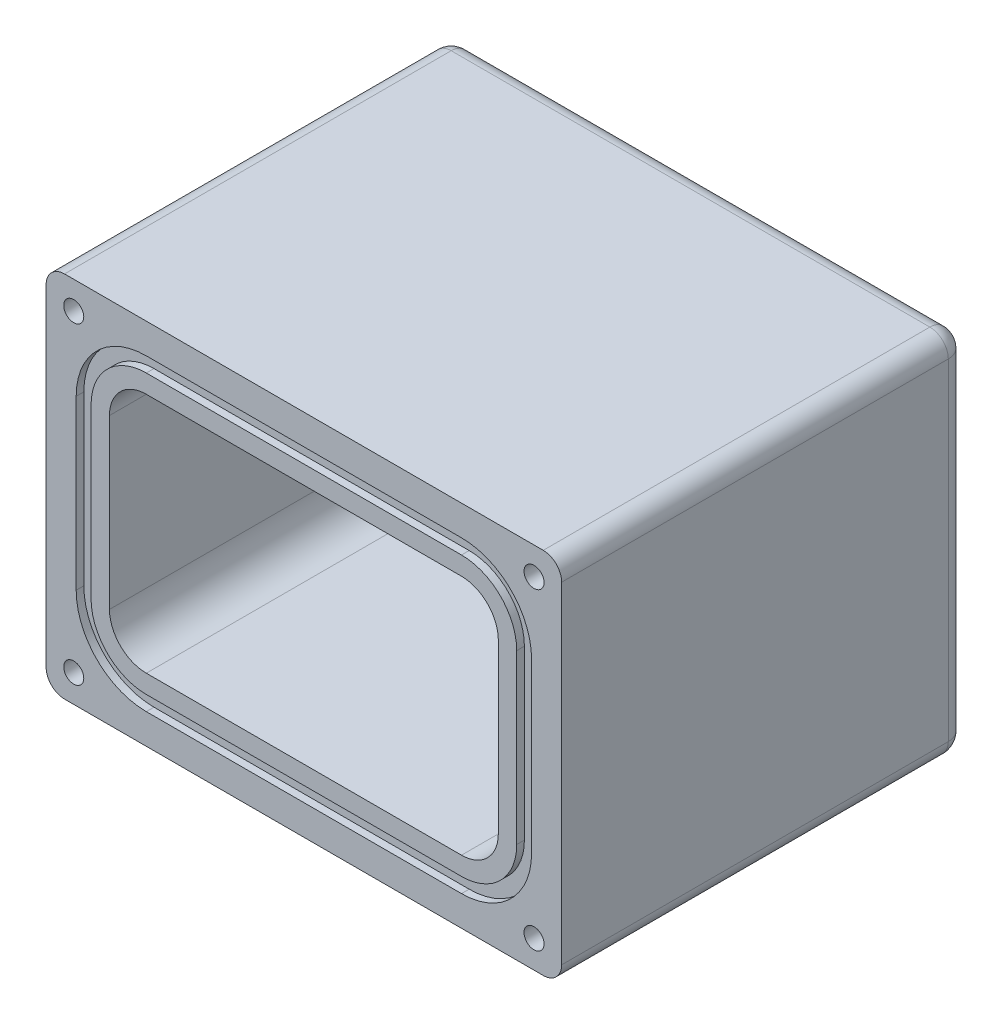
ISO-10303-21;
HEADER;
FILE_DESCRIPTION(('STEP AP214'),'2;1');
FILE_NAME('part.step','',(''),(''),'','','');
FILE_SCHEMA(('AUTOMOTIVE_DESIGN { 1 0 10303 214 1 1 1 1 }'));
ENDSEC;
DATA;
#1=APPLICATION_CONTEXT('core data for automotive mechanical design processes');
#2=APPLICATION_PROTOCOL_DEFINITION('international standard','automotive_design',2000,#1);
#3=PRODUCT_CONTEXT('',#1,'mechanical');
#4=PRODUCT('Part','Part','',(#3));
#5=PRODUCT_RELATED_PRODUCT_CATEGORY('part','',(#4));
#6=PRODUCT_DEFINITION_FORMATION('','',#4);
#7=PRODUCT_DEFINITION_CONTEXT('part definition',#1,'design');
#8=PRODUCT_DEFINITION('design','',#6,#7);
#9=PRODUCT_DEFINITION_SHAPE('','',#8);
#10=(LENGTH_UNIT() NAMED_UNIT(*) SI_UNIT(.MILLI.,.METRE.));
#11=(NAMED_UNIT(*) PLANE_ANGLE_UNIT() SI_UNIT($,.RADIAN.));
#12=(NAMED_UNIT(*) SI_UNIT($,.STERADIAN.) SOLID_ANGLE_UNIT());
#13=UNCERTAINTY_MEASURE_WITH_UNIT(LENGTH_MEASURE(1.E-05),#10,'distance_accuracy_value','');
#14=(GEOMETRIC_REPRESENTATION_CONTEXT(3) GLOBAL_UNCERTAINTY_ASSIGNED_CONTEXT((#13)) GLOBAL_UNIT_ASSIGNED_CONTEXT((#10,
#11,#12)) REPRESENTATION_CONTEXT('',''));
#15=CARTESIAN_POINT('',(0.,0.,0.));
#16=DIRECTION('',(0.,0.,1.));
#17=DIRECTION('',(1.,0.,0.));
#18=AXIS2_PLACEMENT_3D('',#15,#16,#17);
#19=CARTESIAN_POINT('',(0.,0.,69.85));
#20=DIRECTION('',(0.,0.,-1.));
#21=DIRECTION('',(-1.,0.,0.));
#22=AXIS2_PLACEMENT_3D('',#19,#20,#21);
#23=PLANE('',#22);
#24=DIRECTION('',(0.,1.,0.));
#25=VECTOR('',#24,1.);
#26=CARTESIAN_POINT('',(33.528,-20.828,69.85));
#27=LINE('',#26,#25);
#28=CARTESIAN_POINT('',(33.528,-14.478,69.85));
#29=VERTEX_POINT('',#28);
#30=CARTESIAN_POINT('',(33.528,14.478,69.85));
#31=VERTEX_POINT('',#30);
#32=EDGE_CURVE('E513',#29,#31,#27,.T.);
#33=ORIENTED_EDGE('',*,*,#32,.F.);
#34=CARTESIAN_POINT('',(27.178,-14.478,69.85));
#35=DIRECTION('',(0.,0.,-1.));
#36=DIRECTION('',(-1.,0.,0.));
#37=AXIS2_PLACEMENT_3D('',#34,#35,#36);
#38=CIRCLE('',#37,6.35);
#39=CARTESIAN_POINT('',(27.178,-20.828,69.85));
#40=VERTEX_POINT('',#39);
#41=EDGE_CURVE('E574',#29,#40,#38,.T.);
#42=ORIENTED_EDGE('',*,*,#41,.T.);
#43=DIRECTION('',(1.,0.,0.));
#44=VECTOR('',#43,1.);
#45=CARTESIAN_POINT('',(-33.528,-20.828,69.85));
#46=LINE('',#45,#44);
#47=CARTESIAN_POINT('',(-27.178,-20.828,69.85));
#48=VERTEX_POINT('',#47);
#49=EDGE_CURVE('E516',#48,#40,#46,.T.);
#50=ORIENTED_EDGE('',*,*,#49,.F.);
#51=CARTESIAN_POINT('',(-27.178,-14.478,69.85));
#52=DIRECTION('',(0.,0.,-1.));
#53=DIRECTION('',(-1.,0.,0.));
#54=AXIS2_PLACEMENT_3D('',#51,#52,#53);
#55=CIRCLE('',#54,6.35);
#56=CARTESIAN_POINT('',(-33.528,-14.478,69.85));
#57=VERTEX_POINT('',#56);
#58=EDGE_CURVE('E572',#48,#57,#55,.T.);
#59=ORIENTED_EDGE('',*,*,#58,.T.);
#60=DIRECTION('',(0.,-1.,0.));
#61=VECTOR('',#60,1.);
#62=CARTESIAN_POINT('',(-33.528,-20.828,69.85));
#63=LINE('',#62,#61);
#64=CARTESIAN_POINT('',(-33.528,14.478,69.85));
#65=VERTEX_POINT('',#64);
#66=EDGE_CURVE('E506',#65,#57,#63,.T.);
#67=ORIENTED_EDGE('',*,*,#66,.F.);
#68=CARTESIAN_POINT('',(-27.178,14.478,69.85));
#69=DIRECTION('',(0.,0.,-1.));
#70=DIRECTION('',(-1.,0.,0.));
#71=AXIS2_PLACEMENT_3D('',#68,#69,#70);
#72=CIRCLE('',#71,6.35);
#73=CARTESIAN_POINT('',(-27.178,20.828,69.85));
#74=VERTEX_POINT('',#73);
#75=EDGE_CURVE('E578',#65,#74,#72,.T.);
#76=ORIENTED_EDGE('',*,*,#75,.T.);
#77=DIRECTION('',(-1.,0.,0.));
#78=VECTOR('',#77,1.);
#79=CARTESIAN_POINT('',(-33.528,20.828,69.85));
#80=LINE('',#79,#78);
#81=CARTESIAN_POINT('',(27.178,20.828,69.85));
#82=VERTEX_POINT('',#81);
#83=EDGE_CURVE('E509',#82,#74,#80,.T.);
#84=ORIENTED_EDGE('',*,*,#83,.F.);
#85=CARTESIAN_POINT('',(27.178,14.478,69.85));
#86=DIRECTION('',(0.,0.,-1.));
#87=DIRECTION('',(-1.,0.,0.));
#88=AXIS2_PLACEMENT_3D('',#85,#86,#87);
#89=CIRCLE('',#88,6.35);
#90=EDGE_CURVE('E576',#82,#31,#89,.T.);
#91=ORIENTED_EDGE('',*,*,#90,.T.);
#92=EDGE_LOOP('',(#33,#42,#50,#59,#67,#76,#84,#91));
#93=FACE_BOUND('',#92,.T.);
#94=CARTESIAN_POINT('',(-27.178,14.478,69.85));
#95=DIRECTION('',(0.,0.,1.));
#96=DIRECTION('',(-1.,0.,0.));
#97=AXIS2_PLACEMENT_3D('',#94,#95,#96);
#98=CIRCLE('',#97,9.525);
#99=CARTESIAN_POINT('',(-27.178,24.003,69.85));
#100=VERTEX_POINT('',#99);
#101=CARTESIAN_POINT('',(-36.703,14.478,69.85));
#102=VERTEX_POINT('',#101);
#103=EDGE_CURVE('E361',#100,#102,#98,.T.);
#104=ORIENTED_EDGE('',*,*,#103,.T.);
#105=DIRECTION('',(0.,-1.,0.));
#106=VECTOR('',#105,1.);
#107=CARTESIAN_POINT('',(-36.703,14.478,69.85));
#108=LINE('',#107,#106);
#109=CARTESIAN_POINT('',(-36.703,-14.478,69.85));
#110=VERTEX_POINT('',#109);
#111=EDGE_CURVE('E390',#102,#110,#108,.T.);
#112=ORIENTED_EDGE('',*,*,#111,.T.);
#113=CARTESIAN_POINT('',(-27.178,-14.478,69.85));
#114=DIRECTION('',(0.,0.,1.));
#115=DIRECTION('',(-1.,0.,0.));
#116=AXIS2_PLACEMENT_3D('',#113,#114,#115);
#117=CIRCLE('',#116,9.525);
#118=CARTESIAN_POINT('',(-27.178,-24.003,69.85));
#119=VERTEX_POINT('',#118);
#120=EDGE_CURVE('E393',#110,#119,#117,.T.);
#121=ORIENTED_EDGE('',*,*,#120,.T.);
#122=DIRECTION('',(1.,0.,0.));
#123=VECTOR('',#122,1.);
#124=CARTESIAN_POINT('',(-27.178,-24.003,69.85));
#125=LINE('',#124,#123);
#126=CARTESIAN_POINT('',(27.178,-24.003,69.85));
#127=VERTEX_POINT('',#126);
#128=EDGE_CURVE('E396',#119,#127,#125,.T.);
#129=ORIENTED_EDGE('',*,*,#128,.T.);
#130=CARTESIAN_POINT('',(27.178,-14.478,69.85));
#131=DIRECTION('',(0.,0.,1.));
#132=DIRECTION('',(1.,0.,0.));
#133=AXIS2_PLACEMENT_3D('',#130,#131,#132);
#134=CIRCLE('',#133,9.525);
#135=CARTESIAN_POINT('',(36.703,-14.478,69.85));
#136=VERTEX_POINT('',#135);
#137=EDGE_CURVE('E399',#127,#136,#134,.T.);
#138=ORIENTED_EDGE('',*,*,#137,.T.);
#139=DIRECTION('',(0.,1.,0.));
#140=VECTOR('',#139,1.);
#141=CARTESIAN_POINT('',(36.703,14.478,69.85));
#142=LINE('',#141,#140);
#143=CARTESIAN_POINT('',(36.703,14.478,69.85));
#144=VERTEX_POINT('',#143);
#145=EDGE_CURVE('E402',#136,#144,#142,.T.);
#146=ORIENTED_EDGE('',*,*,#145,.T.);
#147=CARTESIAN_POINT('',(27.178,14.478,69.85));
#148=DIRECTION('',(0.,0.,1.));
#149=DIRECTION('',(1.,0.,0.));
#150=AXIS2_PLACEMENT_3D('',#147,#148,#149);
#151=CIRCLE('',#150,9.525);
#152=CARTESIAN_POINT('',(27.178,24.003,69.85));
#153=VERTEX_POINT('',#152);
#154=EDGE_CURVE('E405',#144,#153,#151,.T.);
#155=ORIENTED_EDGE('',*,*,#154,.T.);
#156=DIRECTION('',(-1.,0.,0.));
#157=VECTOR('',#156,1.);
#158=CARTESIAN_POINT('',(-27.178,24.003,69.85));
#159=LINE('',#158,#157);
#160=EDGE_CURVE('E366',#153,#100,#159,.T.);
#161=ORIENTED_EDGE('',*,*,#160,.T.);
#162=EDGE_LOOP('',(#104,#112,#121,#129,#138,#146,#155,#161));
#163=FACE_BOUND('',#162,.T.);
#164=ADVANCED_FACE('F42',(#93,#163),#23,.F.);
#165=CARTESIAN_POINT('',(0.,0.,0.));
#166=DIRECTION('',(0.,0.,-1.));
#167=DIRECTION('',(-1.,0.,0.));
#168=AXIS2_PLACEMENT_3D('',#165,#166,#167);
#169=PLANE('',#168);
#170=CARTESIAN_POINT('',(-14.357199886,7.02929988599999,0.));
#171=DIRECTION('',(0.,0.,1.));
#172=DIRECTION('',(1.,0.,0.));
#173=AXIS2_PLACEMENT_3D('',#170,#171,#172);
#174=CIRCLE('',#173,11.5189);
#175=CARTESIAN_POINT('',(-2.83829988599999,7.02929988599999,0.));
#176=VERTEX_POINT('',#175);
#177=EDGE_CURVE('E503',#176,#176,#174,.T.);
#178=ORIENTED_EDGE('',*,*,#177,.T.);
#179=EDGE_LOOP('',(#178));
#180=FACE_BOUND('',#179,.T.);
#181=CARTESIAN_POINT('',(-14.357199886,7.02929988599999,0.));
#182=DIRECTION('',(0.,0.,-1.));
#183=DIRECTION('',(-1.,0.,0.));
#184=AXIS2_PLACEMENT_3D('',#181,#182,#183);
#185=CIRCLE('',#184,13.3477);
#186=CARTESIAN_POINT('',(-27.704899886,7.02929988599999,0.));
#187=VERTEX_POINT('',#186);
#188=EDGE_CURVE('E476',#187,#187,#185,.T.);
#189=ORIENTED_EDGE('',*,*,#188,.T.);
#190=EDGE_LOOP('',(#189));
#191=FACE_BOUND('',#190,.T.);
#192=ADVANCED_FACE('F721',(#180,#191),#169,.T.);
#193=CARTESIAN_POINT('',(-44.45,-31.75,69.85));
#194=DIRECTION('',(1.,0.,0.));
#195=DIRECTION('',(0.,1.,0.));
#196=AXIS2_PLACEMENT_3D('',#193,#194,#195);
#197=PLANE('',#196);
#198=DIRECTION('',(0.,-1.,0.));
#199=VECTOR('',#198,1.);
#200=CARTESIAN_POINT('',(-44.45,-31.75,3.175));
#201=LINE('',#200,#199);
#202=CARTESIAN_POINT('',(-44.45,28.575,3.175));
#203=VERTEX_POINT('',#202);
#204=CARTESIAN_POINT('',(-44.45,-28.575,3.175));
#205=VERTEX_POINT('',#204);
#206=EDGE_CURVE('E51',#203,#205,#201,.T.);
#207=ORIENTED_EDGE('',*,*,#206,.T.);
#208=DIRECTION('',(0.,0.,-1.));
#209=VECTOR('',#208,1.);
#210=CARTESIAN_POINT('',(-44.45,-28.575,69.85));
#211=LINE('',#210,#209);
#212=CARTESIAN_POINT('',(-44.45,-28.575,69.85));
#213=VERTEX_POINT('',#212);
#214=EDGE_CURVE('E12',#205,#213,#211,.F.);
#215=ORIENTED_EDGE('',*,*,#214,.T.);
#216=DIRECTION('',(0.,-1.,0.));
#217=VECTOR('',#216,1.);
#218=CARTESIAN_POINT('',(-44.45,-31.75,69.85));
#219=LINE('',#218,#217);
#220=CARTESIAN_POINT('',(-44.45,28.575,69.85));
#221=VERTEX_POINT('',#220);
#222=EDGE_CURVE('E527',#221,#213,#219,.T.);
#223=ORIENTED_EDGE('',*,*,#222,.F.);
#224=DIRECTION('',(0.,0.,-1.));
#225=VECTOR('',#224,1.);
#226=CARTESIAN_POINT('',(-44.45,28.575,69.85));
#227=LINE('',#226,#225);
#228=EDGE_CURVE('E62',#221,#203,#227,.T.);
#229=ORIENTED_EDGE('',*,*,#228,.T.);
#230=EDGE_LOOP('',(#207,#215,#223,#229));
#231=FACE_BOUND('',#230,.T.);
#232=ADVANCED_FACE('F696',(#231),#197,.F.);
#233=CARTESIAN_POINT('',(-44.45,-31.75,69.85));
#234=DIRECTION('',(0.,1.,0.));
#235=DIRECTION('',(0.,0.,1.));
#236=AXIS2_PLACEMENT_3D('',#233,#234,#235);
#237=PLANE('',#236);
#238=CARTESIAN_POINT('',(-8.128,-31.75,48.26));
#239=DIRECTION('',(0.,-1.,0.));
#240=DIRECTION('',(0.,0.,-1.));
#241=AXIS2_PLACEMENT_3D('',#238,#239,#240);
#242=CIRCLE('',#241,1.72719999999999);
#243=CARTESIAN_POINT('',(-8.128,-31.75,46.5328));
#244=VERTEX_POINT('',#243);
#245=EDGE_CURVE('E302',#244,#244,#242,.T.);
#246=ORIENTED_EDGE('',*,*,#245,.F.);
#247=EDGE_LOOP('',(#246));
#248=FACE_BOUND('',#247,.T.);
#249=CARTESIAN_POINT('',(8.128,-31.75,57.15));
#250=DIRECTION('',(0.,-1.,0.));
#251=DIRECTION('',(0.,0.,-1.));
#252=AXIS2_PLACEMENT_3D('',#249,#250,#251);
#253=CIRCLE('',#252,1.72719999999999);
#254=CARTESIAN_POINT('',(8.128,-31.75,55.4228));
#255=VERTEX_POINT('',#254);
#256=EDGE_CURVE('E301',#255,#255,#253,.T.);
#257=ORIENTED_EDGE('',*,*,#256,.F.);
#258=EDGE_LOOP('',(#257));
#259=FACE_BOUND('',#258,.T.);
#260=CARTESIAN_POINT('',(-8.128,-31.75,57.15));
#261=DIRECTION('',(0.,-1.,0.));
#262=DIRECTION('',(0.,0.,-1.));
#263=AXIS2_PLACEMENT_3D('',#260,#261,#262);
#264=CIRCLE('',#263,1.72719999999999);
#265=CARTESIAN_POINT('',(-8.128,-31.75,55.4228));
#266=VERTEX_POINT('',#265);
#267=EDGE_CURVE('E312',#266,#266,#264,.T.);
#268=ORIENTED_EDGE('',*,*,#267,.F.);
#269=EDGE_LOOP('',(#268));
#270=FACE_BOUND('',#269,.T.);
#271=CARTESIAN_POINT('',(8.128,-31.75,48.26));
#272=DIRECTION('',(0.,-1.,0.));
#273=DIRECTION('',(0.,0.,-1.));
#274=AXIS2_PLACEMENT_3D('',#271,#272,#273);
#275=CIRCLE('',#274,1.72719999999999);
#276=CARTESIAN_POINT('',(8.128,-31.75,46.5328));
#277=VERTEX_POINT('',#276);
#278=EDGE_CURVE('E318',#277,#277,#275,.T.);
#279=ORIENTED_EDGE('',*,*,#278,.F.);
#280=EDGE_LOOP('',(#279));
#281=FACE_BOUND('',#280,.T.);
#282=DIRECTION('',(1.,0.,0.));
#283=VECTOR('',#282,1.);
#284=CARTESIAN_POINT('',(44.45,-31.75,3.175));
#285=LINE('',#284,#283);
#286=CARTESIAN_POINT('',(-41.275,-31.75,3.175));
#287=VERTEX_POINT('',#286);
#288=CARTESIAN_POINT('',(41.275,-31.75,3.175));
#289=VERTEX_POINT('',#288);
#290=EDGE_CURVE('E589',#287,#289,#285,.T.);
#291=ORIENTED_EDGE('',*,*,#290,.T.);
#292=DIRECTION('',(0.,0.,-1.));
#293=VECTOR('',#292,1.);
#294=CARTESIAN_POINT('',(41.275,-31.75,69.85));
#295=LINE('',#294,#293);
#296=CARTESIAN_POINT('',(41.275,-31.75,69.85));
#297=VERTEX_POINT('',#296);
#298=EDGE_CURVE('E591',#289,#297,#295,.F.);
#299=ORIENTED_EDGE('',*,*,#298,.T.);
#300=DIRECTION('',(1.,0.,0.));
#301=VECTOR('',#300,1.);
#302=CARTESIAN_POINT('',(-44.45,-31.75,69.85));
#303=LINE('',#302,#301);
#304=CARTESIAN_POINT('',(-41.275,-31.75,69.85));
#305=VERTEX_POINT('',#304);
#306=EDGE_CURVE('E535',#305,#297,#303,.T.);
#307=ORIENTED_EDGE('',*,*,#306,.F.);
#308=DIRECTION('',(0.,0.,-1.));
#309=VECTOR('',#308,1.);
#310=CARTESIAN_POINT('',(-41.275,-31.75,69.85));
#311=LINE('',#310,#309);
#312=EDGE_CURVE('E587',#305,#287,#311,.T.);
#313=ORIENTED_EDGE('',*,*,#312,.T.);
#314=EDGE_LOOP('',(#291,#299,#307,#313));
#315=FACE_BOUND('',#314,.T.);
#316=ADVANCED_FACE('F700',(#248,#259,#270,#281,#315),#237,.F.);
#317=CARTESIAN_POINT('',(44.45,-31.75,69.85));
#318=DIRECTION('',(-1.,0.,0.));
#319=DIRECTION('',(0.,-1.,0.));
#320=AXIS2_PLACEMENT_3D('',#317,#318,#319);
#321=PLANE('',#320);
#322=DIRECTION('',(0.,1.,0.));
#323=VECTOR('',#322,1.);
#324=CARTESIAN_POINT('',(44.45,-31.75,69.85));
#325=LINE('',#324,#323);
#326=CARTESIAN_POINT('',(44.45,-28.575,69.85));
#327=VERTEX_POINT('',#326);
#328=CARTESIAN_POINT('',(44.45,28.575,69.85));
#329=VERTEX_POINT('',#328);
#330=EDGE_CURVE('E538',#327,#329,#325,.T.);
#331=ORIENTED_EDGE('',*,*,#330,.F.);
#332=DIRECTION('',(0.,0.,-1.));
#333=VECTOR('',#332,1.);
#334=CARTESIAN_POINT('',(44.45,-28.575,69.85));
#335=LINE('',#334,#333);
#336=CARTESIAN_POINT('',(44.45,-28.575,3.175));
#337=VERTEX_POINT('',#336);
#338=EDGE_CURVE('E584',#327,#337,#335,.T.);
#339=ORIENTED_EDGE('',*,*,#338,.T.);
#340=DIRECTION('',(0.,1.,0.));
#341=VECTOR('',#340,1.);
#342=CARTESIAN_POINT('',(44.45,31.75,3.175));
#343=LINE('',#342,#341);
#344=CARTESIAN_POINT('',(44.45,28.575,3.175));
#345=VERTEX_POINT('',#344);
#346=EDGE_CURVE('E580',#337,#345,#343,.T.);
#347=ORIENTED_EDGE('',*,*,#346,.T.);
#348=DIRECTION('',(0.,0.,-1.));
#349=VECTOR('',#348,1.);
#350=CARTESIAN_POINT('',(44.45,28.575,69.85));
#351=LINE('',#350,#349);
#352=EDGE_CURVE('E582',#345,#329,#351,.F.);
#353=ORIENTED_EDGE('',*,*,#352,.T.);
#354=EDGE_LOOP('',(#331,#339,#347,#353));
#355=FACE_BOUND('',#354,.T.);
#356=ADVANCED_FACE('F710',(#355),#321,.F.);
#357=CARTESIAN_POINT('',(-44.45,31.75,69.85));
#358=DIRECTION('',(0.,-1.,0.));
#359=DIRECTION('',(1.,0.,0.));
#360=AXIS2_PLACEMENT_3D('',#357,#358,#359);
#361=PLANE('',#360);
#362=DIRECTION('',(-1.,0.,0.));
#363=VECTOR('',#362,1.);
#364=CARTESIAN_POINT('',(-44.45,31.75,69.85));
#365=LINE('',#364,#363);
#366=CARTESIAN_POINT('',(41.275,31.75,69.85));
#367=VERTEX_POINT('',#366);
#368=CARTESIAN_POINT('',(-41.275,31.75,69.85));
#369=VERTEX_POINT('',#368);
#370=EDGE_CURVE('E541',#367,#369,#365,.T.);
#371=ORIENTED_EDGE('',*,*,#370,.F.);
#372=DIRECTION('',(0.,0.,-1.));
#373=VECTOR('',#372,1.);
#374=CARTESIAN_POINT('',(41.275,31.75,69.85));
#375=LINE('',#374,#373);
#376=CARTESIAN_POINT('',(41.275,31.75,3.175));
#377=VERTEX_POINT('',#376);
#378=EDGE_CURVE('E605',#367,#377,#375,.T.);
#379=ORIENTED_EDGE('',*,*,#378,.T.);
#380=DIRECTION('',(-1.,0.,0.));
#381=VECTOR('',#380,1.);
#382=CARTESIAN_POINT('',(-44.45,31.75,3.175));
#383=LINE('',#382,#381);
#384=CARTESIAN_POINT('',(-41.275,31.75,3.175));
#385=VERTEX_POINT('',#384);
#386=EDGE_CURVE('E603',#377,#385,#383,.T.);
#387=ORIENTED_EDGE('',*,*,#386,.T.);
#388=DIRECTION('',(0.,0.,-1.));
#389=VECTOR('',#388,1.);
#390=CARTESIAN_POINT('',(-41.275,31.75,69.85));
#391=LINE('',#390,#389);
#392=EDGE_CURVE('E601',#385,#369,#391,.F.);
#393=ORIENTED_EDGE('',*,*,#392,.T.);
#394=EDGE_LOOP('',(#371,#379,#387,#393));
#395=FACE_BOUND('',#394,.T.);
#396=ADVANCED_FACE('F659',(#395),#361,.F.);
#397=CARTESIAN_POINT('',(-39.6875,26.9875,69.85));
#398=DIRECTION('',(0.,0.,1.));
#399=DIRECTION('',(1.,0.,0.));
#400=AXIS2_PLACEMENT_3D('',#397,#398,#399);
#401=CIRCLE('',#400,1.7272);
#402=CARTESIAN_POINT('',(-37.9603,26.9875,69.85));
#403=VERTEX_POINT('',#402);
#404=EDGE_CURVE('E324',#403,#403,#401,.T.);
#405=ORIENTED_EDGE('',*,*,#404,.F.);
#406=EDGE_LOOP('',(#405));
#407=FACE_BOUND('',#406,.T.);
#408=CARTESIAN_POINT('',(39.6875,-26.9875,69.85));
#409=DIRECTION('',(0.,0.,1.));
#410=DIRECTION('',(1.,0.,0.));
#411=AXIS2_PLACEMENT_3D('',#408,#409,#410);
#412=CIRCLE('',#411,1.7272);
#413=CARTESIAN_POINT('',(41.4147,-26.9875,69.85));
#414=VERTEX_POINT('',#413);
#415=EDGE_CURVE('E330',#414,#414,#412,.T.);
#416=ORIENTED_EDGE('',*,*,#415,.F.);
#417=EDGE_LOOP('',(#416));
#418=FACE_BOUND('',#417,.T.);
#419=CARTESIAN_POINT('',(-39.6875,-26.9875,69.85));
#420=DIRECTION('',(0.,0.,1.));
#421=DIRECTION('',(1.,0.,0.));
#422=AXIS2_PLACEMENT_3D('',#419,#420,#421);
#423=CIRCLE('',#422,1.7272);
#424=CARTESIAN_POINT('',(-37.9603,-26.9875,69.85));
#425=VERTEX_POINT('',#424);
#426=EDGE_CURVE('E336',#425,#425,#423,.T.);
#427=ORIENTED_EDGE('',*,*,#426,.F.);
#428=EDGE_LOOP('',(#427));
#429=FACE_BOUND('',#428,.T.);
#430=CARTESIAN_POINT('',(39.6875,26.9875,69.85));
#431=DIRECTION('',(0.,0.,1.));
#432=DIRECTION('',(1.,0.,0.));
#433=AXIS2_PLACEMENT_3D('',#430,#431,#432);
#434=CIRCLE('',#433,1.7272);
#435=CARTESIAN_POINT('',(41.4147,26.9875,69.85));
#436=VERTEX_POINT('',#435);
#437=EDGE_CURVE('E342',#436,#436,#434,.T.);
#438=ORIENTED_EDGE('',*,*,#437,.F.);
#439=EDGE_LOOP('',(#438));
#440=FACE_BOUND('',#439,.T.);
#441=DIRECTION('',(0.,1.,0.));
#442=VECTOR('',#441,1.);
#443=CARTESIAN_POINT('',(39.2684,14.478,69.85));
#444=LINE('',#443,#442);
#445=CARTESIAN_POINT('',(39.2684,-14.478,69.85));
#446=VERTEX_POINT('',#445);
#447=CARTESIAN_POINT('',(39.2684,14.478,69.85));
#448=VERTEX_POINT('',#447);
#449=EDGE_CURVE('E454',#446,#448,#444,.T.);
#450=ORIENTED_EDGE('',*,*,#449,.F.);
#451=CARTESIAN_POINT('',(27.178,-14.478,69.85));
#452=DIRECTION('',(0.,0.,1.));
#453=DIRECTION('',(1.,0.,0.));
#454=AXIS2_PLACEMENT_3D('',#451,#452,#453);
#455=CIRCLE('',#454,12.0904);
#456=CARTESIAN_POINT('',(27.178,-26.5684,69.85));
#457=VERTEX_POINT('',#456);
#458=EDGE_CURVE('E412',#457,#446,#455,.T.);
#459=ORIENTED_EDGE('',*,*,#458,.F.);
#460=DIRECTION('',(1.,0.,0.));
#461=VECTOR('',#460,1.);
#462=CARTESIAN_POINT('',(-27.178,-26.5684,69.85));
#463=LINE('',#462,#461);
#464=CARTESIAN_POINT('',(-27.178,-26.5684,69.85));
#465=VERTEX_POINT('',#464);
#466=EDGE_CURVE('E431',#465,#457,#463,.T.);
#467=ORIENTED_EDGE('',*,*,#466,.F.);
#468=CARTESIAN_POINT('',(-27.178,-14.478,69.85));
#469=DIRECTION('',(0.,0.,1.));
#470=DIRECTION('',(-1.,0.,0.));
#471=AXIS2_PLACEMENT_3D('',#468,#469,#470);
#472=CIRCLE('',#471,12.0904);
#473=CARTESIAN_POINT('',(-39.2684,-14.478,69.85));
#474=VERTEX_POINT('',#473);
#475=EDGE_CURVE('E469',#474,#465,#472,.T.);
#476=ORIENTED_EDGE('',*,*,#475,.F.);
#477=DIRECTION('',(0.,-1.,0.));
#478=VECTOR('',#477,1.);
#479=CARTESIAN_POINT('',(-39.2684,14.478,69.85));
#480=LINE('',#479,#478);
#481=CARTESIAN_POINT('',(-39.2684,14.478,69.85));
#482=VERTEX_POINT('',#481);
#483=EDGE_CURVE('E466',#482,#474,#480,.T.);
#484=ORIENTED_EDGE('',*,*,#483,.F.);
#485=CARTESIAN_POINT('',(-27.178,14.478,69.85));
#486=DIRECTION('',(0.,0.,1.));
#487=DIRECTION('',(-1.,0.,0.));
#488=AXIS2_PLACEMENT_3D('',#485,#486,#487);
#489=CIRCLE('',#488,12.0904);
#490=CARTESIAN_POINT('',(-27.178,26.5684,69.85));
#491=VERTEX_POINT('',#490);
#492=EDGE_CURVE('E463',#491,#482,#489,.T.);
#493=ORIENTED_EDGE('',*,*,#492,.F.);
#494=DIRECTION('',(-1.,0.,0.));
#495=VECTOR('',#494,1.);
#496=CARTESIAN_POINT('',(-27.178,26.5684,69.85));
#497=LINE('',#496,#495);
#498=CARTESIAN_POINT('',(27.178,26.5684,69.85));
#499=VERTEX_POINT('',#498);
#500=EDGE_CURVE('E460',#499,#491,#497,.T.);
#501=ORIENTED_EDGE('',*,*,#500,.F.);
#502=CARTESIAN_POINT('',(27.178,14.478,69.85));
#503=DIRECTION('',(0.,0.,1.));
#504=DIRECTION('',(1.,0.,0.));
#505=AXIS2_PLACEMENT_3D('',#502,#503,#504);
#506=CIRCLE('',#505,12.0904);
#507=EDGE_CURVE('E457',#448,#499,#506,.T.);
#508=ORIENTED_EDGE('',*,*,#507,.F.);
#509=EDGE_LOOP('',(#450,#459,#467,#476,#484,#493,#501,#508));
#510=FACE_BOUND('',#509,.T.);
#511=ORIENTED_EDGE('',*,*,#306,.T.);
#512=CARTESIAN_POINT('',(41.275,-28.575,69.85));
#513=DIRECTION('',(0.,0.,-1.));
#514=DIRECTION('',(-1.,0.,0.));
#515=AXIS2_PLACEMENT_3D('',#512,#513,#514);
#516=CIRCLE('',#515,3.175);
#517=EDGE_CURVE('E599',#297,#327,#516,.F.);
#518=ORIENTED_EDGE('',*,*,#517,.T.);
#519=ORIENTED_EDGE('',*,*,#330,.T.);
#520=CARTESIAN_POINT('',(41.275,28.575,69.85));
#521=DIRECTION('',(0.,0.,-1.));
#522=DIRECTION('',(-1.,0.,0.));
#523=AXIS2_PLACEMENT_3D('',#520,#521,#522);
#524=CIRCLE('',#523,3.175);
#525=EDGE_CURVE('E597',#329,#367,#524,.F.);
#526=ORIENTED_EDGE('',*,*,#525,.T.);
#527=ORIENTED_EDGE('',*,*,#370,.T.);
#528=CARTESIAN_POINT('',(-41.275,28.575,69.85));
#529=DIRECTION('',(0.,0.,-1.));
#530=DIRECTION('',(-1.,0.,0.));
#531=AXIS2_PLACEMENT_3D('',#528,#529,#530);
#532=CIRCLE('',#531,3.175);
#533=EDGE_CURVE('E593',#369,#221,#532,.F.);
#534=ORIENTED_EDGE('',*,*,#533,.T.);
#535=ORIENTED_EDGE('',*,*,#222,.T.);
#536=CARTESIAN_POINT('',(-41.275,-28.575,69.85));
#537=DIRECTION('',(0.,0.,-1.));
#538=DIRECTION('',(-1.,0.,0.));
#539=AXIS2_PLACEMENT_3D('',#536,#537,#538);
#540=CIRCLE('',#539,3.175);
#541=EDGE_CURVE('E595',#213,#305,#540,.F.);
#542=ORIENTED_EDGE('',*,*,#541,.T.);
#543=EDGE_LOOP('',(#511,#518,#519,#526,#527,#534,#535,#542));
#544=FACE_BOUND('',#543,.T.);
#545=ADVANCED_FACE('F662',(#407,#418,#429,#440,#510,#544),#23,.F.);
#546=DIRECTION('',(-1.,0.,0.));
#547=VECTOR('',#546,1.);
#548=CARTESIAN_POINT('',(44.45,28.575,0.));
#549=LINE('',#548,#547);
#550=CARTESIAN_POINT('',(-41.275,28.575,0.));
#551=VERTEX_POINT('',#550);
#552=CARTESIAN_POINT('',(41.275,28.575,0.));
#553=VERTEX_POINT('',#552);
#554=EDGE_CURVE('E607',#551,#553,#549,.F.);
#555=ORIENTED_EDGE('',*,*,#554,.T.);
#556=DIRECTION('',(0.,1.,0.));
#557=VECTOR('',#556,1.);
#558=CARTESIAN_POINT('',(41.275,-31.75,0.));
#559=LINE('',#558,#557);
#560=CARTESIAN_POINT('',(41.275,-28.575,0.));
#561=VERTEX_POINT('',#560);
#562=EDGE_CURVE('E613',#553,#561,#559,.F.);
#563=ORIENTED_EDGE('',*,*,#562,.T.);
#564=DIRECTION('',(1.,0.,0.));
#565=VECTOR('',#564,1.);
#566=CARTESIAN_POINT('',(-44.45,-28.575,0.));
#567=LINE('',#566,#565);
#568=CARTESIAN_POINT('',(-41.275,-28.575,0.));
#569=VERTEX_POINT('',#568);
#570=EDGE_CURVE('E611',#561,#569,#567,.F.);
#571=ORIENTED_EDGE('',*,*,#570,.T.);
#572=DIRECTION('',(0.,-1.,0.));
#573=VECTOR('',#572,1.);
#574=CARTESIAN_POINT('',(-41.275,31.75,0.));
#575=LINE('',#574,#573);
#576=EDGE_CURVE('E609',#569,#551,#575,.F.);
#577=ORIENTED_EDGE('',*,*,#576,.T.);
#578=EDGE_LOOP('',(#555,#563,#571,#577));
#579=FACE_BOUND('',#578,.T.);
#580=CARTESIAN_POINT('',(7.23280011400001,7.02929988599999,0.));
#581=DIRECTION('',(0.,0.,-1.));
#582=DIRECTION('',(-1.,0.,0.));
#583=AXIS2_PLACEMENT_3D('',#580,#581,#582);
#584=CIRCLE('',#583,1.35254999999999);
#585=CARTESIAN_POINT('',(5.88025011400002,7.02929988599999,0.));
#586=VERTEX_POINT('',#585);
#587=EDGE_CURVE('E349',#586,#586,#584,.T.);
#588=ORIENTED_EDGE('',*,*,#587,.F.);
#589=EDGE_LOOP('',(#588));
#590=FACE_BOUND('',#589,.T.);
#591=CARTESIAN_POINT('',(-35.947199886,7.02929988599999,0.));
#592=DIRECTION('',(0.,0.,-1.));
#593=DIRECTION('',(-1.,0.,0.));
#594=AXIS2_PLACEMENT_3D('',#591,#592,#593);
#595=CIRCLE('',#594,1.35254999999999);
#596=CARTESIAN_POINT('',(-37.299749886,7.02929988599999,0.));
#597=VERTEX_POINT('',#596);
#598=EDGE_CURVE('E355',#597,#597,#595,.T.);
#599=ORIENTED_EDGE('',*,*,#598,.F.);
#600=EDGE_LOOP('',(#599));
#601=FACE_BOUND('',#600,.T.);
#602=CARTESIAN_POINT('',(-14.357199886,7.02929988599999,0.));
#603=DIRECTION('',(0.,0.,-1.));
#604=DIRECTION('',(-1.,0.,0.));
#605=AXIS2_PLACEMENT_3D('',#602,#603,#604);
#606=CIRCLE('',#605,15.9131);
#607=CARTESIAN_POINT('',(-30.270299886,7.02929988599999,0.));
#608=VERTEX_POINT('',#607);
#609=EDGE_CURVE('E494',#608,#608,#606,.T.);
#610=ORIENTED_EDGE('',*,*,#609,.F.);
#611=EDGE_LOOP('',(#610));
#612=FACE_BOUND('',#611,.T.);
#613=ADVANCED_FACE('F681',(#579,#590,#601,#612),#169,.T.);
#614=CARTESIAN_POINT('',(0.,0.,8.89));
#615=DIRECTION('',(0.,0.,-1.));
#616=DIRECTION('',(-1.,0.,0.));
#617=AXIS2_PLACEMENT_3D('',#614,#615,#616);
#618=PLANE('',#617);
#619=CARTESIAN_POINT('',(-14.357199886,7.02929988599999,8.89));
#620=DIRECTION('',(0.,0.,1.));
#621=DIRECTION('',(1.,0.,0.));
#622=AXIS2_PLACEMENT_3D('',#619,#620,#621);
#623=CIRCLE('',#622,11.5189);
#624=CARTESIAN_POINT('',(-2.83829988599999,7.02929988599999,8.89));
#625=VERTEX_POINT('',#624);
#626=EDGE_CURVE('E500',#625,#625,#623,.T.);
#627=ORIENTED_EDGE('',*,*,#626,.F.);
#628=EDGE_LOOP('',(#627));
#629=FACE_BOUND('',#628,.T.);
#630=DIRECTION('',(0.,-1.,0.));
#631=VECTOR('',#630,1.);
#632=CARTESIAN_POINT('',(-33.528,-20.828,8.89));
#633=LINE('',#632,#631);
#634=CARTESIAN_POINT('',(-33.528,14.478,8.89));
#635=VERTEX_POINT('',#634);
#636=CARTESIAN_POINT('',(-33.528,-14.478,8.89));
#637=VERTEX_POINT('',#636);
#638=EDGE_CURVE('E524',#635,#637,#633,.T.);
#639=ORIENTED_EDGE('',*,*,#638,.T.);
#640=CARTESIAN_POINT('',(-27.178,-14.478,8.89));
#641=DIRECTION('',(0.,0.,-1.));
#642=DIRECTION('',(-1.,0.,0.));
#643=AXIS2_PLACEMENT_3D('',#640,#641,#642);
#644=CIRCLE('',#643,6.35);
#645=CARTESIAN_POINT('',(-27.178,-20.828,8.89));
#646=VERTEX_POINT('',#645);
#647=EDGE_CURVE('E560',#637,#646,#644,.F.);
#648=ORIENTED_EDGE('',*,*,#647,.T.);
#649=DIRECTION('',(1.,0.,0.));
#650=VECTOR('',#649,1.);
#651=CARTESIAN_POINT('',(-33.528,-20.828,8.89));
#652=LINE('',#651,#650);
#653=CARTESIAN_POINT('',(27.178,-20.828,8.89));
#654=VERTEX_POINT('',#653);
#655=EDGE_CURVE('E512',#646,#654,#652,.T.);
#656=ORIENTED_EDGE('',*,*,#655,.T.);
#657=CARTESIAN_POINT('',(27.178,-14.478,8.89));
#658=DIRECTION('',(0.,0.,-1.));
#659=DIRECTION('',(-1.,0.,0.));
#660=AXIS2_PLACEMENT_3D('',#657,#658,#659);
#661=CIRCLE('',#660,6.35);
#662=CARTESIAN_POINT('',(33.528,-14.478,8.89));
#663=VERTEX_POINT('',#662);
#664=EDGE_CURVE('E558',#654,#663,#661,.F.);
#665=ORIENTED_EDGE('',*,*,#664,.T.);
#666=DIRECTION('',(0.,1.,0.));
#667=VECTOR('',#666,1.);
#668=CARTESIAN_POINT('',(33.528,-20.828,8.89));
#669=LINE('',#668,#667);
#670=CARTESIAN_POINT('',(33.528,14.478,8.89));
#671=VERTEX_POINT('',#670);
#672=EDGE_CURVE('E523',#663,#671,#669,.T.);
#673=ORIENTED_EDGE('',*,*,#672,.T.);
#674=CARTESIAN_POINT('',(27.178,14.478,8.89));
#675=DIRECTION('',(0.,0.,-1.));
#676=DIRECTION('',(-1.,0.,0.));
#677=AXIS2_PLACEMENT_3D('',#674,#675,#676);
#678=CIRCLE('',#677,6.35);
#679=CARTESIAN_POINT('',(27.178,20.828,8.89));
#680=VERTEX_POINT('',#679);
#681=EDGE_CURVE('E556',#671,#680,#678,.F.);
#682=ORIENTED_EDGE('',*,*,#681,.T.);
#683=DIRECTION('',(-1.,0.,0.));
#684=VECTOR('',#683,1.);
#685=CARTESIAN_POINT('',(-33.528,20.828,8.89));
#686=LINE('',#685,#684);
#687=CARTESIAN_POINT('',(-27.178,20.828,8.89));
#688=VERTEX_POINT('',#687);
#689=EDGE_CURVE('E528',#680,#688,#686,.T.);
#690=ORIENTED_EDGE('',*,*,#689,.T.);
#691=CARTESIAN_POINT('',(-27.178,14.478,8.89));
#692=DIRECTION('',(0.,0.,-1.));
#693=DIRECTION('',(-1.,0.,0.));
#694=AXIS2_PLACEMENT_3D('',#691,#692,#693);
#695=CIRCLE('',#694,6.35);
#696=EDGE_CURVE('E554',#688,#635,#695,.F.);
#697=ORIENTED_EDGE('',*,*,#696,.T.);
#698=EDGE_LOOP('',(#639,#648,#656,#665,#673,#682,#690,#697));
#699=FACE_BOUND('',#698,.T.);
#700=ADVANCED_FACE('F737',(#629,#699),#618,.F.);
#701=CARTESIAN_POINT('',(-33.528,-20.828,-78.9413039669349));
#702=DIRECTION('',(0.,-1.,0.));
#703=DIRECTION('',(0.,0.,-1.));
#704=AXIS2_PLACEMENT_3D('',#701,#702,#703);
#705=PLANE('',#704);
#706=ORIENTED_EDGE('',*,*,#655,.F.);
#707=DIRECTION('',(0.,0.,1.));
#708=VECTOR('',#707,1.);
#709=CARTESIAN_POINT('',(-27.178,-20.828,69.85));
#710=LINE('',#709,#708);
#711=EDGE_CURVE('E546',#646,#48,#710,.T.);
#712=ORIENTED_EDGE('',*,*,#711,.T.);
#713=ORIENTED_EDGE('',*,*,#49,.T.);
#714=DIRECTION('',(0.,0.,1.));
#715=VECTOR('',#714,1.);
#716=CARTESIAN_POINT('',(27.178,-20.828,8.89));
#717=LINE('',#716,#715);
#718=EDGE_CURVE('E544',#40,#654,#717,.F.);
#719=ORIENTED_EDGE('',*,*,#718,.T.);
#720=EDGE_LOOP('',(#706,#712,#713,#719));
#721=FACE_BOUND('',#720,.T.);
#722=ADVANCED_FACE('F836',(#721),#705,.F.);
#723=CARTESIAN_POINT('',(33.528,-20.828,-78.9413039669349));
#724=DIRECTION('',(1.,0.,0.));
#725=DIRECTION('',(0.,0.,-1.));
#726=AXIS2_PLACEMENT_3D('',#723,#724,#725);
#727=PLANE('',#726);
#728=ORIENTED_EDGE('',*,*,#672,.F.);
#729=DIRECTION('',(0.,0.,1.));
#730=VECTOR('',#729,1.);
#731=CARTESIAN_POINT('',(33.528,-14.478,69.85));
#732=LINE('',#731,#730);
#733=EDGE_CURVE('E564',#663,#29,#732,.T.);
#734=ORIENTED_EDGE('',*,*,#733,.T.);
#735=ORIENTED_EDGE('',*,*,#32,.T.);
#736=DIRECTION('',(0.,0.,1.));
#737=VECTOR('',#736,1.);
#738=CARTESIAN_POINT('',(33.528,14.478,8.89));
#739=LINE('',#738,#737);
#740=EDGE_CURVE('E562',#31,#671,#739,.F.);
#741=ORIENTED_EDGE('',*,*,#740,.T.);
#742=EDGE_LOOP('',(#728,#734,#735,#741));
#743=FACE_BOUND('',#742,.T.);
#744=ADVANCED_FACE('F832',(#743),#727,.F.);
#745=CARTESIAN_POINT('',(-33.528,20.828,-78.9413039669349));
#746=DIRECTION('',(0.,1.,0.));
#747=DIRECTION('',(0.,0.,1.));
#748=AXIS2_PLACEMENT_3D('',#745,#746,#747);
#749=PLANE('',#748);
#750=ORIENTED_EDGE('',*,*,#689,.F.);
#751=DIRECTION('',(0.,0.,1.));
#752=VECTOR('',#751,1.);
#753=CARTESIAN_POINT('',(27.178,20.828,69.85));
#754=LINE('',#753,#752);
#755=EDGE_CURVE('E569',#680,#82,#754,.T.);
#756=ORIENTED_EDGE('',*,*,#755,.T.);
#757=ORIENTED_EDGE('',*,*,#83,.T.);
#758=DIRECTION('',(0.,0.,1.));
#759=VECTOR('',#758,1.);
#760=CARTESIAN_POINT('',(-27.178,20.828,8.89));
#761=LINE('',#760,#759);
#762=EDGE_CURVE('E567',#74,#688,#761,.F.);
#763=ORIENTED_EDGE('',*,*,#762,.T.);
#764=EDGE_LOOP('',(#750,#756,#757,#763));
#765=FACE_BOUND('',#764,.T.);
#766=ADVANCED_FACE('F828',(#765),#749,.F.);
#767=CARTESIAN_POINT('',(-33.528,-20.828,-78.9413039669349));
#768=DIRECTION('',(-1.,0.,0.));
#769=DIRECTION('',(0.,0.,1.));
#770=AXIS2_PLACEMENT_3D('',#767,#768,#769);
#771=PLANE('',#770);
#772=ORIENTED_EDGE('',*,*,#66,.T.);
#773=DIRECTION('',(0.,0.,1.));
#774=VECTOR('',#773,1.);
#775=CARTESIAN_POINT('',(-33.528,-14.478,8.89));
#776=LINE('',#775,#774);
#777=EDGE_CURVE('E552',#57,#637,#776,.F.);
#778=ORIENTED_EDGE('',*,*,#777,.T.);
#779=ORIENTED_EDGE('',*,*,#638,.F.);
#780=DIRECTION('',(0.,0.,1.));
#781=VECTOR('',#780,1.);
#782=CARTESIAN_POINT('',(-33.528,14.478,69.85));
#783=LINE('',#782,#781);
#784=EDGE_CURVE('E549',#635,#65,#783,.T.);
#785=ORIENTED_EDGE('',*,*,#784,.T.);
#786=EDGE_LOOP('',(#772,#778,#779,#785));
#787=FACE_BOUND('',#786,.T.);
#788=ADVANCED_FACE('F824',(#787),#771,.F.);
#789=CARTESIAN_POINT('',(-14.357199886,7.02929988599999,0.));
#790=DIRECTION('',(0.,0.,1.));
#791=DIRECTION('',(1.,0.,0.));
#792=AXIS2_PLACEMENT_3D('',#789,#790,#791);
#793=CYLINDRICAL_SURFACE('',#792,11.5189);
#794=ORIENTED_EDGE('',*,*,#177,.F.);
#795=EDGE_LOOP('',(#794));
#796=FACE_BOUND('',#795,.T.);
#797=ORIENTED_EDGE('',*,*,#626,.T.);
#798=EDGE_LOOP('',(#797));
#799=FACE_BOUND('',#798,.T.);
#800=ADVANCED_FACE('F820',(#796,#799),#793,.F.);
#801=CARTESIAN_POINT('',(-14.357199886,7.02929988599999,1.3208));
#802=DIRECTION('',(0.,0.,-1.));
#803=DIRECTION('',(-1.,0.,0.));
#804=AXIS2_PLACEMENT_3D('',#801,#802,#803);
#805=CYLINDRICAL_SURFACE('',#804,15.9131);
#806=CARTESIAN_POINT('',(-14.357199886,7.02929988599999,1.3208));
#807=DIRECTION('',(0.,0.,-1.));
#808=DIRECTION('',(-1.,0.,0.));
#809=AXIS2_PLACEMENT_3D('',#806,#807,#808);
#810=CIRCLE('',#809,15.9131);
#811=CARTESIAN_POINT('',(-30.270299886,7.02929988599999,1.3208));
#812=VERTEX_POINT('',#811);
#813=EDGE_CURVE('E497',#812,#812,#810,.T.);
#814=ORIENTED_EDGE('',*,*,#813,.F.);
#815=EDGE_LOOP('',(#814));
#816=FACE_BOUND('',#815,.T.);
#817=ORIENTED_EDGE('',*,*,#609,.T.);
#818=EDGE_LOOP('',(#817));
#819=FACE_BOUND('',#818,.T.);
#820=ADVANCED_FACE('F816',(#816,#819),#805,.F.);
#821=CARTESIAN_POINT('',(-14.357199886,7.02929988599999,1.3208));
#822=DIRECTION('',(0.,0.,-1.));
#823=DIRECTION('',(-1.,0.,0.));
#824=AXIS2_PLACEMENT_3D('',#821,#822,#823);
#825=PLANE('',#824);
#826=CARTESIAN_POINT('',(-14.357199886,7.02929988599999,1.3208));
#827=DIRECTION('',(0.,0.,-1.));
#828=DIRECTION('',(-1.,0.,0.));
#829=AXIS2_PLACEMENT_3D('',#826,#827,#828);
#830=CIRCLE('',#829,13.3477);
#831=CARTESIAN_POINT('',(-27.704899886,7.02929988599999,1.3208));
#832=VERTEX_POINT('',#831);
#833=EDGE_CURVE('E491',#832,#832,#830,.T.);
#834=ORIENTED_EDGE('',*,*,#833,.F.);
#835=EDGE_LOOP('',(#834));
#836=FACE_BOUND('',#835,.T.);
#837=ORIENTED_EDGE('',*,*,#813,.T.);
#838=EDGE_LOOP('',(#837));
#839=FACE_BOUND('',#838,.T.);
#840=ADVANCED_FACE('F812',(#836,#839),#825,.T.);
#841=CARTESIAN_POINT('',(-14.357199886,7.02929988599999,1.3208));
#842=DIRECTION('',(0.,0.,-1.));
#843=DIRECTION('',(-1.,0.,0.));
#844=AXIS2_PLACEMENT_3D('',#841,#842,#843);
#845=CYLINDRICAL_SURFACE('',#844,13.3477);
#846=ORIENTED_EDGE('',*,*,#833,.T.);
#847=EDGE_LOOP('',(#846));
#848=FACE_BOUND('',#847,.T.);
#849=ORIENTED_EDGE('',*,*,#188,.F.);
#850=EDGE_LOOP('',(#849));
#851=FACE_BOUND('',#850,.T.);
#852=ADVANCED_FACE('F809',(#848,#851),#845,.T.);
#853=CARTESIAN_POINT('',(27.178,-14.478,68.5292));
#854=DIRECTION('',(0.,0.,1.));
#855=DIRECTION('',(1.,0.,0.));
#856=AXIS2_PLACEMENT_3D('',#853,#854,#855);
#857=CYLINDRICAL_SURFACE('',#856,12.0904);
#858=ORIENTED_EDGE('',*,*,#458,.T.);
#859=DIRECTION('',(0.,0.,1.));
#860=VECTOR('',#859,1.);
#861=CARTESIAN_POINT('',(39.2684,-14.478,68.5292));
#862=LINE('',#861,#860);
#863=CARTESIAN_POINT('',(39.2684,-14.478,68.5292));
#864=VERTEX_POINT('',#863);
#865=EDGE_CURVE('E452',#864,#446,#862,.T.);
#866=ORIENTED_EDGE('',*,*,#865,.F.);
#867=CARTESIAN_POINT('',(27.178,-14.478,68.5292));
#868=DIRECTION('',(0.,0.,1.));
#869=DIRECTION('',(1.,0.,0.));
#870=AXIS2_PLACEMENT_3D('',#867,#868,#869);
#871=CIRCLE('',#870,12.0904);
#872=CARTESIAN_POINT('',(27.178,-26.5684,68.5292));
#873=VERTEX_POINT('',#872);
#874=EDGE_CURVE('E427',#873,#864,#871,.T.);
#875=ORIENTED_EDGE('',*,*,#874,.F.);
#876=DIRECTION('',(0.,0.,1.));
#877=VECTOR('',#876,1.);
#878=CARTESIAN_POINT('',(27.178,-26.5684,68.5292));
#879=LINE('',#878,#877);
#880=EDGE_CURVE('E474',#873,#457,#879,.T.);
#881=ORIENTED_EDGE('',*,*,#880,.T.);
#882=EDGE_LOOP('',(#858,#866,#875,#881));
#883=FACE_BOUND('',#882,.T.);
#884=ADVANCED_FACE('F757',(#883),#857,.F.);
#885=CARTESIAN_POINT('',(-27.178,-26.5684,68.5292));
#886=DIRECTION('',(0.,-1.,0.));
#887=DIRECTION('',(0.,0.,-1.));
#888=AXIS2_PLACEMENT_3D('',#885,#886,#887);
#889=PLANE('',#888);
#890=ORIENTED_EDGE('',*,*,#466,.T.);
#891=ORIENTED_EDGE('',*,*,#880,.F.);
#892=DIRECTION('',(1.,0.,0.));
#893=VECTOR('',#892,1.);
#894=CARTESIAN_POINT('',(-27.178,-26.5684,68.5292));
#895=LINE('',#894,#893);
#896=CARTESIAN_POINT('',(-27.178,-26.5684,68.5292));
#897=VERTEX_POINT('',#896);
#898=EDGE_CURVE('E449',#897,#873,#895,.T.);
#899=ORIENTED_EDGE('',*,*,#898,.F.);
#900=DIRECTION('',(0.,0.,1.));
#901=VECTOR('',#900,1.);
#902=CARTESIAN_POINT('',(-27.178,-26.5684,68.5292));
#903=LINE('',#902,#901);
#904=EDGE_CURVE('E477',#897,#465,#903,.T.);
#905=ORIENTED_EDGE('',*,*,#904,.T.);
#906=EDGE_LOOP('',(#890,#891,#899,#905));
#907=FACE_BOUND('',#906,.T.);
#908=ADVANCED_FACE('F760',(#907),#889,.F.);
#909=CARTESIAN_POINT('',(-27.178,-14.478,68.5292));
#910=DIRECTION('',(0.,0.,1.));
#911=DIRECTION('',(1.,0.,0.));
#912=AXIS2_PLACEMENT_3D('',#909,#910,#911);
#913=CYLINDRICAL_SURFACE('',#912,12.0904);
#914=ORIENTED_EDGE('',*,*,#475,.T.);
#915=ORIENTED_EDGE('',*,*,#904,.F.);
#916=CARTESIAN_POINT('',(-27.178,-14.478,68.5292));
#917=DIRECTION('',(0.,0.,1.));
#918=DIRECTION('',(-1.,0.,0.));
#919=AXIS2_PLACEMENT_3D('',#916,#917,#918);
#920=CIRCLE('',#919,12.0904);
#921=CARTESIAN_POINT('',(-39.2684,-14.478,68.5292));
#922=VERTEX_POINT('',#921);
#923=EDGE_CURVE('E446',#922,#897,#920,.T.);
#924=ORIENTED_EDGE('',*,*,#923,.F.);
#925=DIRECTION('',(0.,0.,1.));
#926=VECTOR('',#925,1.);
#927=CARTESIAN_POINT('',(-39.2684,-14.478,68.5292));
#928=LINE('',#927,#926);
#929=EDGE_CURVE('E479',#922,#474,#928,.T.);
#930=ORIENTED_EDGE('',*,*,#929,.T.);
#931=EDGE_LOOP('',(#914,#915,#924,#930));
#932=FACE_BOUND('',#931,.T.);
#933=ADVANCED_FACE('F765',(#932),#913,.F.);
#934=CARTESIAN_POINT('',(-39.2684,14.478,68.5292));
#935=DIRECTION('',(-1.,0.,0.));
#936=DIRECTION('',(0.,0.,1.));
#937=AXIS2_PLACEMENT_3D('',#934,#935,#936);
#938=PLANE('',#937);
#939=ORIENTED_EDGE('',*,*,#483,.T.);
#940=ORIENTED_EDGE('',*,*,#929,.F.);
#941=DIRECTION('',(0.,-1.,0.));
#942=VECTOR('',#941,1.);
#943=CARTESIAN_POINT('',(-39.2684,14.478,68.5292));
#944=LINE('',#943,#942);
#945=CARTESIAN_POINT('',(-39.2684,14.478,68.5292));
#946=VERTEX_POINT('',#945);
#947=EDGE_CURVE('E443',#946,#922,#944,.T.);
#948=ORIENTED_EDGE('',*,*,#947,.F.);
#949=DIRECTION('',(0.,0.,1.));
#950=VECTOR('',#949,1.);
#951=CARTESIAN_POINT('',(-39.2684,14.478,68.5292));
#952=LINE('',#951,#950);
#953=EDGE_CURVE('E481',#946,#482,#952,.T.);
#954=ORIENTED_EDGE('',*,*,#953,.T.);
#955=EDGE_LOOP('',(#939,#940,#948,#954));
#956=FACE_BOUND('',#955,.T.);
#957=ADVANCED_FACE('F769',(#956),#938,.F.);
#958=CARTESIAN_POINT('',(-27.178,14.478,68.5292));
#959=DIRECTION('',(0.,0.,1.));
#960=DIRECTION('',(1.,0.,0.));
#961=AXIS2_PLACEMENT_3D('',#958,#959,#960);
#962=CYLINDRICAL_SURFACE('',#961,12.0904);
#963=ORIENTED_EDGE('',*,*,#492,.T.);
#964=ORIENTED_EDGE('',*,*,#953,.F.);
#965=CARTESIAN_POINT('',(-27.178,14.478,68.5292));
#966=DIRECTION('',(0.,0.,1.));
#967=DIRECTION('',(-1.,0.,0.));
#968=AXIS2_PLACEMENT_3D('',#965,#966,#967);
#969=CIRCLE('',#968,12.0904);
#970=CARTESIAN_POINT('',(-27.178,26.5684,68.5292));
#971=VERTEX_POINT('',#970);
#972=EDGE_CURVE('E440',#971,#946,#969,.T.);
#973=ORIENTED_EDGE('',*,*,#972,.F.);
#974=DIRECTION('',(0.,0.,1.));
#975=VECTOR('',#974,1.);
#976=CARTESIAN_POINT('',(-27.178,26.5684,68.5292));
#977=LINE('',#976,#975);
#978=EDGE_CURVE('E483',#971,#491,#977,.T.);
#979=ORIENTED_EDGE('',*,*,#978,.T.);
#980=EDGE_LOOP('',(#963,#964,#973,#979));
#981=FACE_BOUND('',#980,.T.);
#982=ADVANCED_FACE('F772',(#981),#962,.F.);
#983=CARTESIAN_POINT('',(-27.178,26.5684,68.5292));
#984=DIRECTION('',(0.,1.,0.));
#985=DIRECTION('',(0.,0.,1.));
#986=AXIS2_PLACEMENT_3D('',#983,#984,#985);
#987=PLANE('',#986);
#988=ORIENTED_EDGE('',*,*,#500,.T.);
#989=ORIENTED_EDGE('',*,*,#978,.F.);
#990=DIRECTION('',(-1.,0.,0.));
#991=VECTOR('',#990,1.);
#992=CARTESIAN_POINT('',(-27.178,26.5684,68.5292));
#993=LINE('',#992,#991);
#994=CARTESIAN_POINT('',(27.178,26.5684,68.5292));
#995=VERTEX_POINT('',#994);
#996=EDGE_CURVE('E437',#995,#971,#993,.T.);
#997=ORIENTED_EDGE('',*,*,#996,.F.);
#998=DIRECTION('',(0.,0.,1.));
#999=VECTOR('',#998,1.);
#1000=CARTESIAN_POINT('',(27.178,26.5684,68.5292));
#1001=LINE('',#1000,#999);
#1002=EDGE_CURVE('E485',#995,#499,#1001,.T.);
#1003=ORIENTED_EDGE('',*,*,#1002,.T.);
#1004=EDGE_LOOP('',(#988,#989,#997,#1003));
#1005=FACE_BOUND('',#1004,.T.);
#1006=ADVANCED_FACE('F774',(#1005),#987,.F.);
#1007=CARTESIAN_POINT('',(27.178,14.478,68.5292));
#1008=DIRECTION('',(0.,0.,1.));
#1009=DIRECTION('',(1.,0.,0.));
#1010=AXIS2_PLACEMENT_3D('',#1007,#1008,#1009);
#1011=CYLINDRICAL_SURFACE('',#1010,12.0904);
#1012=ORIENTED_EDGE('',*,*,#507,.T.);
#1013=ORIENTED_EDGE('',*,*,#1002,.F.);
#1014=CARTESIAN_POINT('',(27.178,14.478,68.5292));
#1015=DIRECTION('',(0.,0.,1.));
#1016=DIRECTION('',(1.,0.,0.));
#1017=AXIS2_PLACEMENT_3D('',#1014,#1015,#1016);
#1018=CIRCLE('',#1017,12.0904);
#1019=CARTESIAN_POINT('',(39.2684,14.478,68.5292));
#1020=VERTEX_POINT('',#1019);
#1021=EDGE_CURVE('E434',#1020,#995,#1018,.T.);
#1022=ORIENTED_EDGE('',*,*,#1021,.F.);
#1023=DIRECTION('',(0.,0.,1.));
#1024=VECTOR('',#1023,1.);
#1025=CARTESIAN_POINT('',(39.2684,14.478,68.5292));
#1026=LINE('',#1025,#1024);
#1027=EDGE_CURVE('E487',#1020,#448,#1026,.T.);
#1028=ORIENTED_EDGE('',*,*,#1027,.T.);
#1029=EDGE_LOOP('',(#1012,#1013,#1022,#1028));
#1030=FACE_BOUND('',#1029,.T.);
#1031=ADVANCED_FACE('F777',(#1030),#1011,.F.);
#1032=CARTESIAN_POINT('',(39.2684,14.478,68.5292));
#1033=DIRECTION('',(1.,0.,0.));
#1034=DIRECTION('',(0.,0.,-1.));
#1035=AXIS2_PLACEMENT_3D('',#1032,#1033,#1034);
#1036=PLANE('',#1035);
#1037=ORIENTED_EDGE('',*,*,#449,.T.);
#1038=ORIENTED_EDGE('',*,*,#1027,.F.);
#1039=DIRECTION('',(0.,1.,0.));
#1040=VECTOR('',#1039,1.);
#1041=CARTESIAN_POINT('',(39.2684,14.478,68.5292));
#1042=LINE('',#1041,#1040);
#1043=EDGE_CURVE('E430',#864,#1020,#1042,.T.);
#1044=ORIENTED_EDGE('',*,*,#1043,.F.);
#1045=ORIENTED_EDGE('',*,*,#865,.T.);
#1046=EDGE_LOOP('',(#1037,#1038,#1044,#1045));
#1047=FACE_BOUND('',#1046,.T.);
#1048=ADVANCED_FACE('F752',(#1047),#1036,.F.);
#1049=CARTESIAN_POINT('',(27.178,-14.478,68.5292));
#1050=DIRECTION('',(0.,0.,1.));
#1051=DIRECTION('',(1.,0.,0.));
#1052=AXIS2_PLACEMENT_3D('',#1049,#1050,#1051);
#1053=PLANE('',#1052);
#1054=DIRECTION('',(-1.,0.,0.));
#1055=VECTOR('',#1054,1.);
#1056=CARTESIAN_POINT('',(-27.178,24.003,68.5292));
#1057=LINE('',#1056,#1055);
#1058=CARTESIAN_POINT('',(27.178,24.003,68.5292));
#1059=VERTEX_POINT('',#1058);
#1060=CARTESIAN_POINT('',(-27.178,24.003,68.5292));
#1061=VERTEX_POINT('',#1060);
#1062=EDGE_CURVE('E384',#1059,#1061,#1057,.T.);
#1063=ORIENTED_EDGE('',*,*,#1062,.F.);
#1064=CARTESIAN_POINT('',(27.178,14.478,68.5292));
#1065=DIRECTION('',(0.,0.,1.));
#1066=DIRECTION('',(1.,0.,0.));
#1067=AXIS2_PLACEMENT_3D('',#1064,#1065,#1066);
#1068=CIRCLE('',#1067,9.525);
#1069=CARTESIAN_POINT('',(36.703,14.478,68.5292));
#1070=VERTEX_POINT('',#1069);
#1071=EDGE_CURVE('E381',#1070,#1059,#1068,.T.);
#1072=ORIENTED_EDGE('',*,*,#1071,.F.);
#1073=DIRECTION('',(0.,1.,0.));
#1074=VECTOR('',#1073,1.);
#1075=CARTESIAN_POINT('',(36.703,14.478,68.5292));
#1076=LINE('',#1075,#1074);
#1077=CARTESIAN_POINT('',(36.703,-14.478,68.5292));
#1078=VERTEX_POINT('',#1077);
#1079=EDGE_CURVE('E378',#1078,#1070,#1076,.T.);
#1080=ORIENTED_EDGE('',*,*,#1079,.F.);
#1081=CARTESIAN_POINT('',(27.178,-14.478,68.5292));
#1082=DIRECTION('',(0.,0.,1.));
#1083=DIRECTION('',(1.,0.,0.));
#1084=AXIS2_PLACEMENT_3D('',#1081,#1082,#1083);
#1085=CIRCLE('',#1084,9.525);
#1086=CARTESIAN_POINT('',(27.178,-24.003,68.5292));
#1087=VERTEX_POINT('',#1086);
#1088=EDGE_CURVE('E375',#1087,#1078,#1085,.T.);
#1089=ORIENTED_EDGE('',*,*,#1088,.F.);
#1090=DIRECTION('',(1.,0.,0.));
#1091=VECTOR('',#1090,1.);
#1092=CARTESIAN_POINT('',(-27.178,-24.003,68.5292));
#1093=LINE('',#1092,#1091);
#1094=CARTESIAN_POINT('',(-27.178,-24.003,68.5292));
#1095=VERTEX_POINT('',#1094);
#1096=EDGE_CURVE('E372',#1095,#1087,#1093,.T.);
#1097=ORIENTED_EDGE('',*,*,#1096,.F.);
#1098=CARTESIAN_POINT('',(-27.178,-14.478,68.5292));
#1099=DIRECTION('',(0.,0.,1.));
#1100=DIRECTION('',(-1.,0.,0.));
#1101=AXIS2_PLACEMENT_3D('',#1098,#1099,#1100);
#1102=CIRCLE('',#1101,9.525);
#1103=CARTESIAN_POINT('',(-36.703,-14.478,68.5292));
#1104=VERTEX_POINT('',#1103);
#1105=EDGE_CURVE('E369',#1104,#1095,#1102,.T.);
#1106=ORIENTED_EDGE('',*,*,#1105,.F.);
#1107=DIRECTION('',(0.,-1.,0.));
#1108=VECTOR('',#1107,1.);
#1109=CARTESIAN_POINT('',(-36.703,14.478,68.5292));
#1110=LINE('',#1109,#1108);
#1111=CARTESIAN_POINT('',(-36.703,14.478,68.5292));
#1112=VERTEX_POINT('',#1111);
#1113=EDGE_CURVE('E365',#1112,#1104,#1110,.T.);
#1114=ORIENTED_EDGE('',*,*,#1113,.F.);
#1115=CARTESIAN_POINT('',(-27.178,14.478,68.5292));
#1116=DIRECTION('',(0.,0.,1.));
#1117=DIRECTION('',(-1.,0.,0.));
#1118=AXIS2_PLACEMENT_3D('',#1115,#1116,#1117);
#1119=CIRCLE('',#1118,9.525);
#1120=EDGE_CURVE('E362',#1061,#1112,#1119,.T.);
#1121=ORIENTED_EDGE('',*,*,#1120,.F.);
#1122=EDGE_LOOP('',(#1063,#1072,#1080,#1089,#1097,#1106,#1114,#1121));
#1123=FACE_BOUND('',#1122,.T.);
#1124=ORIENTED_EDGE('',*,*,#874,.T.);
#1125=ORIENTED_EDGE('',*,*,#1043,.T.);
#1126=ORIENTED_EDGE('',*,*,#1021,.T.);
#1127=ORIENTED_EDGE('',*,*,#996,.T.);
#1128=ORIENTED_EDGE('',*,*,#972,.T.);
#1129=ORIENTED_EDGE('',*,*,#947,.T.);
#1130=ORIENTED_EDGE('',*,*,#923,.T.);
#1131=ORIENTED_EDGE('',*,*,#898,.T.);
#1132=EDGE_LOOP('',(#1124,#1125,#1126,#1127,#1128,#1129,#1130,#1131));
#1133=FACE_BOUND('',#1132,.T.);
#1134=ADVANCED_FACE('F779',(#1123,#1133),#1053,.T.);
#1135=CARTESIAN_POINT('',(-27.178,14.478,68.5292));
#1136=DIRECTION('',(0.,0.,1.));
#1137=DIRECTION('',(1.,0.,0.));
#1138=AXIS2_PLACEMENT_3D('',#1135,#1136,#1137);
#1139=CYLINDRICAL_SURFACE('',#1138,9.525);
#1140=ORIENTED_EDGE('',*,*,#103,.F.);
#1141=DIRECTION('',(0.,0.,1.));
#1142=VECTOR('',#1141,1.);
#1143=CARTESIAN_POINT('',(-27.178,24.003,68.5292));
#1144=LINE('',#1143,#1142);
#1145=EDGE_CURVE('E410',#1061,#100,#1144,.T.);
#1146=ORIENTED_EDGE('',*,*,#1145,.F.);
#1147=ORIENTED_EDGE('',*,*,#1120,.T.);
#1148=DIRECTION('',(0.,0.,1.));
#1149=VECTOR('',#1148,1.);
#1150=CARTESIAN_POINT('',(-36.703,14.478,68.5292));
#1151=LINE('',#1150,#1149);
#1152=EDGE_CURVE('E387',#1112,#102,#1151,.T.);
#1153=ORIENTED_EDGE('',*,*,#1152,.T.);
#1154=EDGE_LOOP('',(#1140,#1146,#1147,#1153));
#1155=FACE_BOUND('',#1154,.T.);
#1156=ADVANCED_FACE('F781',(#1155),#1139,.T.);
#1157=CARTESIAN_POINT('',(-27.178,24.003,68.5292));
#1158=DIRECTION('',(0.,1.,0.));
#1159=DIRECTION('',(0.,0.,1.));
#1160=AXIS2_PLACEMENT_3D('',#1157,#1158,#1159);
#1161=PLANE('',#1160);
#1162=ORIENTED_EDGE('',*,*,#160,.F.);
#1163=DIRECTION('',(0.,0.,1.));
#1164=VECTOR('',#1163,1.);
#1165=CARTESIAN_POINT('',(27.178,24.003,68.5292));
#1166=LINE('',#1165,#1164);
#1167=EDGE_CURVE('E413',#1059,#153,#1166,.T.);
#1168=ORIENTED_EDGE('',*,*,#1167,.F.);
#1169=ORIENTED_EDGE('',*,*,#1062,.T.);
#1170=ORIENTED_EDGE('',*,*,#1145,.T.);
#1171=EDGE_LOOP('',(#1162,#1168,#1169,#1170));
#1172=FACE_BOUND('',#1171,.T.);
#1173=ADVANCED_FACE('F788',(#1172),#1161,.T.);
#1174=CARTESIAN_POINT('',(27.178,14.478,68.5292));
#1175=DIRECTION('',(0.,0.,1.));
#1176=DIRECTION('',(1.,0.,0.));
#1177=AXIS2_PLACEMENT_3D('',#1174,#1175,#1176);
#1178=CYLINDRICAL_SURFACE('',#1177,9.525);
#1179=ORIENTED_EDGE('',*,*,#154,.F.);
#1180=DIRECTION('',(0.,0.,1.));
#1181=VECTOR('',#1180,1.);
#1182=CARTESIAN_POINT('',(36.703,14.478,68.5292));
#1183=LINE('',#1182,#1181);
#1184=EDGE_CURVE('E415',#1070,#144,#1183,.T.);
#1185=ORIENTED_EDGE('',*,*,#1184,.F.);
#1186=ORIENTED_EDGE('',*,*,#1071,.T.);
#1187=ORIENTED_EDGE('',*,*,#1167,.T.);
#1188=EDGE_LOOP('',(#1179,#1185,#1186,#1187));
#1189=FACE_BOUND('',#1188,.T.);
#1190=ADVANCED_FACE('F934',(#1189),#1178,.T.);
#1191=CARTESIAN_POINT('',(36.703,14.478,68.5292));
#1192=DIRECTION('',(1.,0.,0.));
#1193=DIRECTION('',(0.,1.,0.));
#1194=AXIS2_PLACEMENT_3D('',#1191,#1192,#1193);
#1195=PLANE('',#1194);
#1196=ORIENTED_EDGE('',*,*,#145,.F.);
#1197=DIRECTION('',(0.,0.,1.));
#1198=VECTOR('',#1197,1.);
#1199=CARTESIAN_POINT('',(36.703,-14.478,68.5292));
#1200=LINE('',#1199,#1198);
#1201=EDGE_CURVE('E417',#1078,#136,#1200,.T.);
#1202=ORIENTED_EDGE('',*,*,#1201,.F.);
#1203=ORIENTED_EDGE('',*,*,#1079,.T.);
#1204=ORIENTED_EDGE('',*,*,#1184,.T.);
#1205=EDGE_LOOP('',(#1196,#1202,#1203,#1204));
#1206=FACE_BOUND('',#1205,.T.);
#1207=ADVANCED_FACE('F938',(#1206),#1195,.T.);
#1208=CARTESIAN_POINT('',(27.178,-14.478,68.5292));
#1209=DIRECTION('',(0.,0.,1.));
#1210=DIRECTION('',(1.,0.,0.));
#1211=AXIS2_PLACEMENT_3D('',#1208,#1209,#1210);
#1212=CYLINDRICAL_SURFACE('',#1211,9.525);
#1213=ORIENTED_EDGE('',*,*,#137,.F.);
#1214=DIRECTION('',(0.,0.,1.));
#1215=VECTOR('',#1214,1.);
#1216=CARTESIAN_POINT('',(27.178,-24.003,68.5292));
#1217=LINE('',#1216,#1215);
#1218=EDGE_CURVE('E419',#1087,#127,#1217,.T.);
#1219=ORIENTED_EDGE('',*,*,#1218,.F.);
#1220=ORIENTED_EDGE('',*,*,#1088,.T.);
#1221=ORIENTED_EDGE('',*,*,#1201,.T.);
#1222=EDGE_LOOP('',(#1213,#1219,#1220,#1221));
#1223=FACE_BOUND('',#1222,.T.);
#1224=ADVANCED_FACE('F942',(#1223),#1212,.T.);
#1225=CARTESIAN_POINT('',(-27.178,-24.003,68.5292));
#1226=DIRECTION('',(0.,-1.,0.));
#1227=DIRECTION('',(1.,0.,0.));
#1228=AXIS2_PLACEMENT_3D('',#1225,#1226,#1227);
#1229=PLANE('',#1228);
#1230=ORIENTED_EDGE('',*,*,#128,.F.);
#1231=DIRECTION('',(0.,0.,1.));
#1232=VECTOR('',#1231,1.);
#1233=CARTESIAN_POINT('',(-27.178,-24.003,68.5292));
#1234=LINE('',#1233,#1232);
#1235=EDGE_CURVE('E421',#1095,#119,#1234,.T.);
#1236=ORIENTED_EDGE('',*,*,#1235,.F.);
#1237=ORIENTED_EDGE('',*,*,#1096,.T.);
#1238=ORIENTED_EDGE('',*,*,#1218,.T.);
#1239=EDGE_LOOP('',(#1230,#1236,#1237,#1238));
#1240=FACE_BOUND('',#1239,.T.);
#1241=ADVANCED_FACE('F946',(#1240),#1229,.T.);
#1242=CARTESIAN_POINT('',(-27.178,-14.478,68.5292));
#1243=DIRECTION('',(0.,0.,1.));
#1244=DIRECTION('',(1.,0.,0.));
#1245=AXIS2_PLACEMENT_3D('',#1242,#1243,#1244);
#1246=CYLINDRICAL_SURFACE('',#1245,9.525);
#1247=ORIENTED_EDGE('',*,*,#120,.F.);
#1248=DIRECTION('',(0.,0.,1.));
#1249=VECTOR('',#1248,1.);
#1250=CARTESIAN_POINT('',(-36.703,-14.478,68.5292));
#1251=LINE('',#1250,#1249);
#1252=EDGE_CURVE('E423',#1104,#110,#1251,.T.);
#1253=ORIENTED_EDGE('',*,*,#1252,.F.);
#1254=ORIENTED_EDGE('',*,*,#1105,.T.);
#1255=ORIENTED_EDGE('',*,*,#1235,.T.);
#1256=EDGE_LOOP('',(#1247,#1253,#1254,#1255));
#1257=FACE_BOUND('',#1256,.T.);
#1258=ADVANCED_FACE('F950',(#1257),#1246,.T.);
#1259=CARTESIAN_POINT('',(-36.703,14.478,68.5292));
#1260=DIRECTION('',(-1.,0.,0.));
#1261=DIRECTION('',(0.,0.,1.));
#1262=AXIS2_PLACEMENT_3D('',#1259,#1260,#1261);
#1263=PLANE('',#1262);
#1264=ORIENTED_EDGE('',*,*,#111,.F.);
#1265=ORIENTED_EDGE('',*,*,#1152,.F.);
#1266=ORIENTED_EDGE('',*,*,#1113,.T.);
#1267=ORIENTED_EDGE('',*,*,#1252,.T.);
#1268=EDGE_LOOP('',(#1264,#1265,#1266,#1267));
#1269=FACE_BOUND('',#1268,.T.);
#1270=ADVANCED_FACE('F953',(#1269),#1263,.T.);
#1271=CARTESIAN_POINT('',(-27.178,-14.478,-78.9413039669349));
#1272=DIRECTION('',(0.,0.,-1.));
#1273=DIRECTION('',(-1.,0.,0.));
#1274=AXIS2_PLACEMENT_3D('',#1271,#1272,#1273);
#1275=CYLINDRICAL_SURFACE('',#1274,6.35);
#1276=ORIENTED_EDGE('',*,*,#647,.F.);
#1277=ORIENTED_EDGE('',*,*,#777,.F.);
#1278=ORIENTED_EDGE('',*,*,#58,.F.);
#1279=ORIENTED_EDGE('',*,*,#711,.F.);
#1280=EDGE_LOOP('',(#1276,#1277,#1278,#1279));
#1281=FACE_BOUND('',#1280,.T.);
#1282=ADVANCED_FACE('F854',(#1281),#1275,.F.);
#1283=CARTESIAN_POINT('',(27.178,-14.478,-78.9413039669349));
#1284=DIRECTION('',(0.,0.,-1.));
#1285=DIRECTION('',(-1.,0.,0.));
#1286=AXIS2_PLACEMENT_3D('',#1283,#1284,#1285);
#1287=CYLINDRICAL_SURFACE('',#1286,6.35);
#1288=ORIENTED_EDGE('',*,*,#664,.F.);
#1289=ORIENTED_EDGE('',*,*,#718,.F.);
#1290=ORIENTED_EDGE('',*,*,#41,.F.);
#1291=ORIENTED_EDGE('',*,*,#733,.F.);
#1292=EDGE_LOOP('',(#1288,#1289,#1290,#1291));
#1293=FACE_BOUND('',#1292,.T.);
#1294=ADVANCED_FACE('F861',(#1293),#1287,.F.);
#1295=CARTESIAN_POINT('',(27.178,14.478,-78.9413039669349));
#1296=DIRECTION('',(0.,0.,-1.));
#1297=DIRECTION('',(-1.,0.,0.));
#1298=AXIS2_PLACEMENT_3D('',#1295,#1296,#1297);
#1299=CYLINDRICAL_SURFACE('',#1298,6.35);
#1300=ORIENTED_EDGE('',*,*,#681,.F.);
#1301=ORIENTED_EDGE('',*,*,#740,.F.);
#1302=ORIENTED_EDGE('',*,*,#90,.F.);
#1303=ORIENTED_EDGE('',*,*,#755,.F.);
#1304=EDGE_LOOP('',(#1300,#1301,#1302,#1303));
#1305=FACE_BOUND('',#1304,.T.);
#1306=ADVANCED_FACE('F868',(#1305),#1299,.F.);
#1307=CARTESIAN_POINT('',(-27.178,14.478,-78.9413039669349));
#1308=DIRECTION('',(0.,0.,-1.));
#1309=DIRECTION('',(-1.,0.,0.));
#1310=AXIS2_PLACEMENT_3D('',#1307,#1308,#1309);
#1311=CYLINDRICAL_SURFACE('',#1310,6.35);
#1312=ORIENTED_EDGE('',*,*,#696,.F.);
#1313=ORIENTED_EDGE('',*,*,#762,.F.);
#1314=ORIENTED_EDGE('',*,*,#75,.F.);
#1315=ORIENTED_EDGE('',*,*,#784,.F.);
#1316=EDGE_LOOP('',(#1312,#1313,#1314,#1315));
#1317=FACE_BOUND('',#1316,.T.);
#1318=ADVANCED_FACE('F872',(#1317),#1311,.F.);
#1319=CARTESIAN_POINT('',(-35.947199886,7.02929988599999,6.35));
#1320=DIRECTION('',(0.,0.,-1.));
#1321=DIRECTION('',(-1.,0.,0.));
#1322=AXIS2_PLACEMENT_3D('',#1319,#1320,#1321);
#1323=CONICAL_SURFACE('',#1322,1.35254999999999,1.02974425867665);
#1324=CARTESIAN_POINT('',(-35.947199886,7.02929988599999,7.16269403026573));
#1325=VERTEX_POINT('',#1324);
#1326=VERTEX_LOOP('',#1325);
#1327=FACE_BOUND('',#1326,.T.);
#1328=CARTESIAN_POINT('',(-35.947199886,7.02929988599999,6.35));
#1329=DIRECTION('',(0.,0.,-1.));
#1330=DIRECTION('',(-1.,0.,0.));
#1331=AXIS2_PLACEMENT_3D('',#1328,#1329,#1330);
#1332=CIRCLE('',#1331,1.35254999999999);
#1333=CARTESIAN_POINT('',(-37.299749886,7.02929988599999,6.35));
#1334=VERTEX_POINT('',#1333);
#1335=EDGE_CURVE('E358',#1334,#1334,#1332,.T.);
#1336=ORIENTED_EDGE('',*,*,#1335,.T.);
#1337=EDGE_LOOP('',(#1336));
#1338=FACE_BOUND('',#1337,.T.);
#1339=ADVANCED_FACE('F874',(#1327,#1338),#1323,.F.);
#1340=CARTESIAN_POINT('',(-35.947199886,7.02929988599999,0.));
#1341=DIRECTION('',(0.,0.,-1.));
#1342=DIRECTION('',(-1.,0.,0.));
#1343=AXIS2_PLACEMENT_3D('',#1340,#1341,#1342);
#1344=CYLINDRICAL_SURFACE('',#1343,1.35254999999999);
#1345=ORIENTED_EDGE('',*,*,#1335,.F.);
#1346=EDGE_LOOP('',(#1345));
#1347=FACE_BOUND('',#1346,.T.);
#1348=ORIENTED_EDGE('',*,*,#598,.T.);
#1349=EDGE_LOOP('',(#1348));
#1350=FACE_BOUND('',#1349,.T.);
#1351=ADVANCED_FACE('F880',(#1347,#1350),#1344,.F.);
#1352=CARTESIAN_POINT('',(7.23280011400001,7.02929988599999,6.35));
#1353=DIRECTION('',(0.,0.,-1.));
#1354=DIRECTION('',(-1.,0.,0.));
#1355=AXIS2_PLACEMENT_3D('',#1352,#1353,#1354);
#1356=CONICAL_SURFACE('',#1355,1.35255,1.02974425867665);
#1357=CARTESIAN_POINT('',(7.23280011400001,7.02929988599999,7.16269403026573));
#1358=VERTEX_POINT('',#1357);
#1359=VERTEX_LOOP('',#1358);
#1360=FACE_BOUND('',#1359,.T.);
#1361=CARTESIAN_POINT('',(7.23280011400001,7.02929988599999,6.35));
#1362=DIRECTION('',(0.,0.,-1.));
#1363=DIRECTION('',(-1.,0.,0.));
#1364=AXIS2_PLACEMENT_3D('',#1361,#1362,#1363);
#1365=CIRCLE('',#1364,1.35255);
#1366=CARTESIAN_POINT('',(5.88025011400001,7.02929988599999,6.35));
#1367=VERTEX_POINT('',#1366);
#1368=EDGE_CURVE('E352',#1367,#1367,#1365,.T.);
#1369=ORIENTED_EDGE('',*,*,#1368,.T.);
#1370=EDGE_LOOP('',(#1369));
#1371=FACE_BOUND('',#1370,.T.);
#1372=ADVANCED_FACE('F916',(#1360,#1371),#1356,.F.);
#1373=CARTESIAN_POINT('',(7.23280011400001,7.02929988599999,0.));
#1374=DIRECTION('',(0.,0.,-1.));
#1375=DIRECTION('',(-1.,0.,0.));
#1376=AXIS2_PLACEMENT_3D('',#1373,#1374,#1375);
#1377=CYLINDRICAL_SURFACE('',#1376,1.35254999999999);
#1378=ORIENTED_EDGE('',*,*,#1368,.F.);
#1379=EDGE_LOOP('',(#1378));
#1380=FACE_BOUND('',#1379,.T.);
#1381=ORIENTED_EDGE('',*,*,#587,.T.);
#1382=EDGE_LOOP('',(#1381));
#1383=FACE_BOUND('',#1382,.T.);
#1384=ADVANCED_FACE('F912',(#1380,#1383),#1377,.F.);
#1385=CARTESIAN_POINT('',(-41.275,28.575,69.85));
#1386=DIRECTION('',(0.,0.,-1.));
#1387=DIRECTION('',(-1.,0.,0.));
#1388=AXIS2_PLACEMENT_3D('',#1385,#1386,#1387);
#1389=CYLINDRICAL_SURFACE('',#1388,3.175);
#1390=CARTESIAN_POINT('',(-41.275,28.575,3.175));
#1391=DIRECTION('',(0.,0.,-1.));
#1392=DIRECTION('',(-1.,0.,0.));
#1393=AXIS2_PLACEMENT_3D('',#1390,#1391,#1392);
#1394=CIRCLE('',#1393,3.175);
#1395=EDGE_CURVE('E46',#203,#385,#1394,.T.);
#1396=ORIENTED_EDGE('',*,*,#1395,.F.);
#1397=ORIENTED_EDGE('',*,*,#228,.F.);
#1398=ORIENTED_EDGE('',*,*,#533,.F.);
#1399=ORIENTED_EDGE('',*,*,#392,.F.);
#1400=EDGE_LOOP('',(#1396,#1397,#1398,#1399));
#1401=FACE_BOUND('',#1400,.T.);
#1402=ADVANCED_FACE('F44',(#1401),#1389,.T.);
#1403=CARTESIAN_POINT('',(-41.275,28.575,3.175));
#1404=DIRECTION('',(0.,0.,1.));
#1405=DIRECTION('',(1.,0.,0.));
#1406=AXIS2_PLACEMENT_3D('',#1403,#1404,#1405);
#1407=SPHERICAL_SURFACE('',#1406,3.175);
#1408=CARTESIAN_POINT('',(-41.275,28.575,3.175));
#1409=DIRECTION('',(0.,1.,0.));
#1410=DIRECTION('',(-1.,0.,0.));
#1411=AXIS2_PLACEMENT_3D('',#1408,#1409,#1410);
#1412=CIRCLE('',#1411,3.175);
#1413=EDGE_CURVE('E642',#203,#551,#1412,.F.);
#1414=ORIENTED_EDGE('',*,*,#1413,.F.);
#1415=ORIENTED_EDGE('',*,*,#1395,.T.);
#1416=CARTESIAN_POINT('',(-41.275,28.575,3.175));
#1417=DIRECTION('',(-1.,0.,0.));
#1418=DIRECTION('',(0.,0.,1.));
#1419=AXIS2_PLACEMENT_3D('',#1416,#1417,#1418);
#1420=CIRCLE('',#1419,3.175);
#1421=EDGE_CURVE('E644',#551,#385,#1420,.F.);
#1422=ORIENTED_EDGE('',*,*,#1421,.F.);
#1423=EDGE_LOOP('',(#1414,#1415,#1422));
#1424=FACE_BOUND('',#1423,.T.);
#1425=ADVANCED_FACE('F653',(#1424),#1407,.T.);
#1426=CARTESIAN_POINT('',(41.275,28.575,69.85));
#1427=DIRECTION('',(0.,0.,-1.));
#1428=DIRECTION('',(-1.,0.,0.));
#1429=AXIS2_PLACEMENT_3D('',#1426,#1427,#1428);
#1430=CYLINDRICAL_SURFACE('',#1429,3.175);
#1431=ORIENTED_EDGE('',*,*,#525,.F.);
#1432=ORIENTED_EDGE('',*,*,#352,.F.);
#1433=CARTESIAN_POINT('',(41.275,28.575,3.175));
#1434=DIRECTION('',(0.,0.,-1.));
#1435=DIRECTION('',(-1.,0.,0.));
#1436=AXIS2_PLACEMENT_3D('',#1433,#1434,#1435);
#1437=CIRCLE('',#1436,3.175);
#1438=EDGE_CURVE('E639',#377,#345,#1437,.T.);
#1439=ORIENTED_EDGE('',*,*,#1438,.F.);
#1440=ORIENTED_EDGE('',*,*,#378,.F.);
#1441=EDGE_LOOP('',(#1431,#1432,#1439,#1440));
#1442=FACE_BOUND('',#1441,.T.);
#1443=ADVANCED_FACE('F667',(#1442),#1430,.T.);
#1444=CARTESIAN_POINT('',(-44.45,28.575,3.175));
#1445=DIRECTION('',(1.,0.,0.));
#1446=DIRECTION('',(0.,1.,0.));
#1447=AXIS2_PLACEMENT_3D('',#1444,#1445,#1446);
#1448=CYLINDRICAL_SURFACE('',#1447,3.175);
#1449=ORIENTED_EDGE('',*,*,#1421,.T.);
#1450=ORIENTED_EDGE('',*,*,#386,.F.);
#1451=CARTESIAN_POINT('',(41.275,28.575,3.175));
#1452=DIRECTION('',(1.,0.,0.));
#1453=DIRECTION('',(0.,1.,0.));
#1454=AXIS2_PLACEMENT_3D('',#1451,#1452,#1453);
#1455=CIRCLE('',#1454,3.175);
#1456=EDGE_CURVE('E636',#553,#377,#1455,.T.);
#1457=ORIENTED_EDGE('',*,*,#1456,.F.);
#1458=ORIENTED_EDGE('',*,*,#554,.F.);
#1459=EDGE_LOOP('',(#1449,#1450,#1457,#1458));
#1460=FACE_BOUND('',#1459,.T.);
#1461=ADVANCED_FACE('F670',(#1460),#1448,.T.);
#1462=CARTESIAN_POINT('',(-41.275,-31.75,3.175));
#1463=DIRECTION('',(0.,1.,0.));
#1464=DIRECTION('',(-1.,0.,0.));
#1465=AXIS2_PLACEMENT_3D('',#1462,#1463,#1464);
#1466=CYLINDRICAL_SURFACE('',#1465,3.175);
#1467=ORIENTED_EDGE('',*,*,#1413,.T.);
#1468=ORIENTED_EDGE('',*,*,#576,.F.);
#1469=CARTESIAN_POINT('',(-41.275,-28.575,3.175));
#1470=DIRECTION('',(0.,-1.,0.));
#1471=DIRECTION('',(0.,0.,-1.));
#1472=AXIS2_PLACEMENT_3D('',#1469,#1470,#1471);
#1473=CIRCLE('',#1472,3.175);
#1474=EDGE_CURVE('E633',#205,#569,#1473,.T.);
#1475=ORIENTED_EDGE('',*,*,#1474,.F.);
#1476=ORIENTED_EDGE('',*,*,#206,.F.);
#1477=EDGE_LOOP('',(#1467,#1468,#1475,#1476));
#1478=FACE_BOUND('',#1477,.T.);
#1479=ADVANCED_FACE('F686',(#1478),#1466,.T.);
#1480=CARTESIAN_POINT('',(-41.275,-28.575,69.85));
#1481=DIRECTION('',(0.,0.,-1.));
#1482=DIRECTION('',(-1.,0.,0.));
#1483=AXIS2_PLACEMENT_3D('',#1480,#1481,#1482);
#1484=CYLINDRICAL_SURFACE('',#1483,3.175);
#1485=ORIENTED_EDGE('',*,*,#541,.F.);
#1486=ORIENTED_EDGE('',*,*,#214,.F.);
#1487=CARTESIAN_POINT('',(-41.275,-28.575,3.175));
#1488=DIRECTION('',(0.,0.,-1.));
#1489=DIRECTION('',(-1.,0.,0.));
#1490=AXIS2_PLACEMENT_3D('',#1487,#1488,#1489);
#1491=CIRCLE('',#1490,3.175);
#1492=EDGE_CURVE('E630',#287,#205,#1491,.T.);
#1493=ORIENTED_EDGE('',*,*,#1492,.F.);
#1494=ORIENTED_EDGE('',*,*,#312,.F.);
#1495=EDGE_LOOP('',(#1485,#1486,#1493,#1494));
#1496=FACE_BOUND('',#1495,.T.);
#1497=ADVANCED_FACE('F695',(#1496),#1484,.T.);
#1498=CARTESIAN_POINT('',(41.275,28.575,3.175));
#1499=DIRECTION('',(0.,0.,1.));
#1500=DIRECTION('',(1.,0.,0.));
#1501=AXIS2_PLACEMENT_3D('',#1498,#1499,#1500);
#1502=SPHERICAL_SURFACE('',#1501,3.175);
#1503=ORIENTED_EDGE('',*,*,#1456,.T.);
#1504=ORIENTED_EDGE('',*,*,#1438,.T.);
#1505=CARTESIAN_POINT('',(41.275,28.575,3.175));
#1506=DIRECTION('',(0.,1.,0.));
#1507=DIRECTION('',(0.,0.,1.));
#1508=AXIS2_PLACEMENT_3D('',#1505,#1506,#1507);
#1509=CIRCLE('',#1508,3.175);
#1510=EDGE_CURVE('E627',#553,#345,#1509,.F.);
#1511=ORIENTED_EDGE('',*,*,#1510,.F.);
#1512=EDGE_LOOP('',(#1503,#1504,#1511));
#1513=FACE_BOUND('',#1512,.T.);
#1514=ADVANCED_FACE('F674',(#1513),#1502,.T.);
#1515=CARTESIAN_POINT('',(-41.275,-28.575,3.175));
#1516=DIRECTION('',(0.,0.,1.));
#1517=DIRECTION('',(1.,0.,0.));
#1518=AXIS2_PLACEMENT_3D('',#1515,#1516,#1517);
#1519=SPHERICAL_SURFACE('',#1518,3.175);
#1520=ORIENTED_EDGE('',*,*,#1492,.T.);
#1521=ORIENTED_EDGE('',*,*,#1474,.T.);
#1522=CARTESIAN_POINT('',(-41.275,-28.575,3.175));
#1523=DIRECTION('',(-1.,0.,0.));
#1524=DIRECTION('',(0.,0.,1.));
#1525=AXIS2_PLACEMENT_3D('',#1522,#1523,#1524);
#1526=CIRCLE('',#1525,3.175);
#1527=EDGE_CURVE('E624',#287,#569,#1526,.F.);
#1528=ORIENTED_EDGE('',*,*,#1527,.F.);
#1529=EDGE_LOOP('',(#1520,#1521,#1528));
#1530=FACE_BOUND('',#1529,.T.);
#1531=ADVANCED_FACE('F690',(#1530),#1519,.T.);
#1532=CARTESIAN_POINT('',(41.275,-31.75,3.175));
#1533=DIRECTION('',(0.,-1.,0.));
#1534=DIRECTION('',(1.,0.,0.));
#1535=AXIS2_PLACEMENT_3D('',#1532,#1533,#1534);
#1536=CYLINDRICAL_SURFACE('',#1535,3.175);
#1537=ORIENTED_EDGE('',*,*,#1510,.T.);
#1538=ORIENTED_EDGE('',*,*,#346,.F.);
#1539=CARTESIAN_POINT('',(41.275,-28.575,3.175));
#1540=DIRECTION('',(0.,-1.,0.));
#1541=DIRECTION('',(0.,0.,-1.));
#1542=AXIS2_PLACEMENT_3D('',#1539,#1540,#1541);
#1543=CIRCLE('',#1542,3.175);
#1544=EDGE_CURVE('E621',#561,#337,#1543,.T.);
#1545=ORIENTED_EDGE('',*,*,#1544,.F.);
#1546=ORIENTED_EDGE('',*,*,#562,.F.);
#1547=EDGE_LOOP('',(#1537,#1538,#1545,#1546));
#1548=FACE_BOUND('',#1547,.T.);
#1549=ADVANCED_FACE('F678',(#1548),#1536,.T.);
#1550=CARTESIAN_POINT('',(-44.45,-28.575,3.175));
#1551=DIRECTION('',(-1.,0.,0.));
#1552=DIRECTION('',(0.,0.,1.));
#1553=AXIS2_PLACEMENT_3D('',#1550,#1551,#1552);
#1554=CYLINDRICAL_SURFACE('',#1553,3.175);
#1555=ORIENTED_EDGE('',*,*,#1527,.T.);
#1556=ORIENTED_EDGE('',*,*,#570,.F.);
#1557=CARTESIAN_POINT('',(41.275,-28.575,3.175));
#1558=DIRECTION('',(1.,0.,0.));
#1559=DIRECTION('',(0.,0.,-1.));
#1560=AXIS2_PLACEMENT_3D('',#1557,#1558,#1559);
#1561=CIRCLE('',#1560,3.175);
#1562=EDGE_CURVE('E619',#289,#561,#1561,.T.);
#1563=ORIENTED_EDGE('',*,*,#1562,.F.);
#1564=ORIENTED_EDGE('',*,*,#290,.F.);
#1565=EDGE_LOOP('',(#1555,#1556,#1563,#1564));
#1566=FACE_BOUND('',#1565,.T.);
#1567=ADVANCED_FACE('F891',(#1566),#1554,.T.);
#1568=CARTESIAN_POINT('',(41.275,-28.575,3.175));
#1569=DIRECTION('',(0.,0.,1.));
#1570=DIRECTION('',(1.,0.,0.));
#1571=AXIS2_PLACEMENT_3D('',#1568,#1569,#1570);
#1572=SPHERICAL_SURFACE('',#1571,3.175);
#1573=ORIENTED_EDGE('',*,*,#1562,.T.);
#1574=ORIENTED_EDGE('',*,*,#1544,.T.);
#1575=CARTESIAN_POINT('',(41.275,-28.575,3.175));
#1576=DIRECTION('',(0.,0.,-1.));
#1577=DIRECTION('',(-1.,0.,0.));
#1578=AXIS2_PLACEMENT_3D('',#1575,#1576,#1577);
#1579=CIRCLE('',#1578,3.175);
#1580=EDGE_CURVE('E348',#289,#337,#1579,.F.);
#1581=ORIENTED_EDGE('',*,*,#1580,.F.);
#1582=EDGE_LOOP('',(#1573,#1574,#1581));
#1583=FACE_BOUND('',#1582,.T.);
#1584=ADVANCED_FACE('F708',(#1583),#1572,.T.);
#1585=CARTESIAN_POINT('',(41.275,-28.575,69.85));
#1586=DIRECTION('',(0.,0.,-1.));
#1587=DIRECTION('',(-1.,0.,0.));
#1588=AXIS2_PLACEMENT_3D('',#1585,#1586,#1587);
#1589=CYLINDRICAL_SURFACE('',#1588,3.175);
#1590=ORIENTED_EDGE('',*,*,#517,.F.);
#1591=ORIENTED_EDGE('',*,*,#298,.F.);
#1592=ORIENTED_EDGE('',*,*,#1580,.T.);
#1593=ORIENTED_EDGE('',*,*,#338,.F.);
#1594=EDGE_LOOP('',(#1590,#1591,#1592,#1593));
#1595=FACE_BOUND('',#1594,.T.);
#1596=ADVANCED_FACE('F705',(#1595),#1589,.T.);
#1597=CARTESIAN_POINT('',(39.6875,26.9875,60.325));
#1598=DIRECTION('',(0.,0.,1.));
#1599=DIRECTION('',(1.,0.,0.));
#1600=AXIS2_PLACEMENT_3D('',#1597,#1598,#1599);
#1601=CONICAL_SURFACE('',#1600,1.7272,1.02974425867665);
#1602=CARTESIAN_POINT('',(39.6875,26.9875,59.2871935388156));
#1603=VERTEX_POINT('',#1602);
#1604=VERTEX_LOOP('',#1603);
#1605=FACE_BOUND('',#1604,.T.);
#1606=CARTESIAN_POINT('',(39.6875,26.9875,60.325));
#1607=DIRECTION('',(0.,0.,1.));
#1608=DIRECTION('',(1.,0.,0.));
#1609=AXIS2_PLACEMENT_3D('',#1606,#1607,#1608);
#1610=CIRCLE('',#1609,1.7272);
#1611=CARTESIAN_POINT('',(41.4147,26.9875,60.325));
#1612=VERTEX_POINT('',#1611);
#1613=EDGE_CURVE('E345',#1612,#1612,#1610,.T.);
#1614=ORIENTED_EDGE('',*,*,#1613,.T.);
#1615=EDGE_LOOP('',(#1614));
#1616=FACE_BOUND('',#1615,.T.);
#1617=ADVANCED_FACE('F888',(#1605,#1616),#1601,.F.);
#1618=CARTESIAN_POINT('',(39.6875,26.9875,69.85));
#1619=DIRECTION('',(0.,0.,1.));
#1620=DIRECTION('',(1.,0.,0.));
#1621=AXIS2_PLACEMENT_3D('',#1618,#1619,#1620);
#1622=CYLINDRICAL_SURFACE('',#1621,1.7272);
#1623=ORIENTED_EDGE('',*,*,#1613,.F.);
#1624=EDGE_LOOP('',(#1623));
#1625=FACE_BOUND('',#1624,.T.);
#1626=ORIENTED_EDGE('',*,*,#437,.T.);
#1627=EDGE_LOOP('',(#1626));
#1628=FACE_BOUND('',#1627,.T.);
#1629=ADVANCED_FACE('F1096',(#1625,#1628),#1622,.F.);
#1630=CARTESIAN_POINT('',(-39.6875,-26.9875,60.325));
#1631=DIRECTION('',(0.,0.,1.));
#1632=DIRECTION('',(1.,0.,0.));
#1633=AXIS2_PLACEMENT_3D('',#1630,#1631,#1632);
#1634=CONICAL_SURFACE('',#1633,1.7272,1.02974425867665);
#1635=CARTESIAN_POINT('',(-39.6875,-26.9875,59.2871935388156));
#1636=VERTEX_POINT('',#1635);
#1637=VERTEX_LOOP('',#1636);
#1638=FACE_BOUND('',#1637,.T.);
#1639=CARTESIAN_POINT('',(-39.6875,-26.9875,60.325));
#1640=DIRECTION('',(0.,0.,1.));
#1641=DIRECTION('',(1.,0.,0.));
#1642=AXIS2_PLACEMENT_3D('',#1639,#1640,#1641);
#1643=CIRCLE('',#1642,1.7272);
#1644=CARTESIAN_POINT('',(-37.9603,-26.9875,60.325));
#1645=VERTEX_POINT('',#1644);
#1646=EDGE_CURVE('E339',#1645,#1645,#1643,.T.);
#1647=ORIENTED_EDGE('',*,*,#1646,.T.);
#1648=EDGE_LOOP('',(#1647));
#1649=FACE_BOUND('',#1648,.T.);
#1650=ADVANCED_FACE('F1093',(#1638,#1649),#1634,.F.);
#1651=CARTESIAN_POINT('',(-39.6875,-26.9875,69.85));
#1652=DIRECTION('',(0.,0.,1.));
#1653=DIRECTION('',(1.,0.,0.));
#1654=AXIS2_PLACEMENT_3D('',#1651,#1652,#1653);
#1655=CYLINDRICAL_SURFACE('',#1654,1.7272);
#1656=ORIENTED_EDGE('',*,*,#1646,.F.);
#1657=EDGE_LOOP('',(#1656));
#1658=FACE_BOUND('',#1657,.T.);
#1659=ORIENTED_EDGE('',*,*,#426,.T.);
#1660=EDGE_LOOP('',(#1659));
#1661=FACE_BOUND('',#1660,.T.);
#1662=ADVANCED_FACE('F1089',(#1658,#1661),#1655,.F.);
#1663=CARTESIAN_POINT('',(39.6875,-26.9875,60.325));
#1664=DIRECTION('',(0.,0.,1.));
#1665=DIRECTION('',(1.,0.,0.));
#1666=AXIS2_PLACEMENT_3D('',#1663,#1664,#1665);
#1667=CONICAL_SURFACE('',#1666,1.7272,1.02974425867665);
#1668=CARTESIAN_POINT('',(39.6875,-26.9875,59.2871935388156));
#1669=VERTEX_POINT('',#1668);
#1670=VERTEX_LOOP('',#1669);
#1671=FACE_BOUND('',#1670,.T.);
#1672=CARTESIAN_POINT('',(39.6875,-26.9875,60.325));
#1673=DIRECTION('',(0.,0.,1.));
#1674=DIRECTION('',(1.,0.,0.));
#1675=AXIS2_PLACEMENT_3D('',#1672,#1673,#1674);
#1676=CIRCLE('',#1675,1.7272);
#1677=CARTESIAN_POINT('',(41.4147,-26.9875,60.325));
#1678=VERTEX_POINT('',#1677);
#1679=EDGE_CURVE('E333',#1678,#1678,#1676,.T.);
#1680=ORIENTED_EDGE('',*,*,#1679,.T.);
#1681=EDGE_LOOP('',(#1680));
#1682=FACE_BOUND('',#1681,.T.);
#1683=ADVANCED_FACE('F1085',(#1671,#1682),#1667,.F.);
#1684=CARTESIAN_POINT('',(39.6875,-26.9875,69.85));
#1685=DIRECTION('',(0.,0.,1.));
#1686=DIRECTION('',(1.,0.,0.));
#1687=AXIS2_PLACEMENT_3D('',#1684,#1685,#1686);
#1688=CYLINDRICAL_SURFACE('',#1687,1.7272);
#1689=ORIENTED_EDGE('',*,*,#1679,.F.);
#1690=EDGE_LOOP('',(#1689));
#1691=FACE_BOUND('',#1690,.T.);
#1692=ORIENTED_EDGE('',*,*,#415,.T.);
#1693=EDGE_LOOP('',(#1692));
#1694=FACE_BOUND('',#1693,.T.);
#1695=ADVANCED_FACE('F1081',(#1691,#1694),#1688,.F.);
#1696=CARTESIAN_POINT('',(-39.6875,26.9875,60.325));
#1697=DIRECTION('',(0.,0.,1.));
#1698=DIRECTION('',(1.,0.,0.));
#1699=AXIS2_PLACEMENT_3D('',#1696,#1697,#1698);
#1700=CONICAL_SURFACE('',#1699,1.7272,1.02974425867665);
#1701=CARTESIAN_POINT('',(-39.6875,26.9875,59.2871935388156));
#1702=VERTEX_POINT('',#1701);
#1703=VERTEX_LOOP('',#1702);
#1704=FACE_BOUND('',#1703,.T.);
#1705=CARTESIAN_POINT('',(-39.6875,26.9875,60.325));
#1706=DIRECTION('',(0.,0.,1.));
#1707=DIRECTION('',(1.,0.,0.));
#1708=AXIS2_PLACEMENT_3D('',#1705,#1706,#1707);
#1709=CIRCLE('',#1708,1.7272);
#1710=CARTESIAN_POINT('',(-37.9603,26.9875,60.325));
#1711=VERTEX_POINT('',#1710);
#1712=EDGE_CURVE('E327',#1711,#1711,#1709,.T.);
#1713=ORIENTED_EDGE('',*,*,#1712,.T.);
#1714=EDGE_LOOP('',(#1713));
#1715=FACE_BOUND('',#1714,.T.);
#1716=ADVANCED_FACE('F1077',(#1704,#1715),#1700,.F.);
#1717=CARTESIAN_POINT('',(-39.6875,26.9875,69.85));
#1718=DIRECTION('',(0.,0.,1.));
#1719=DIRECTION('',(1.,0.,0.));
#1720=AXIS2_PLACEMENT_3D('',#1717,#1718,#1719);
#1721=CYLINDRICAL_SURFACE('',#1720,1.7272);
#1722=ORIENTED_EDGE('',*,*,#1712,.F.);
#1723=EDGE_LOOP('',(#1722));
#1724=FACE_BOUND('',#1723,.T.);
#1725=ORIENTED_EDGE('',*,*,#404,.T.);
#1726=EDGE_LOOP('',(#1725));
#1727=FACE_BOUND('',#1726,.T.);
#1728=ADVANCED_FACE('F996',(#1724,#1727),#1721,.F.);
#1729=CARTESIAN_POINT('',(8.128,-25.4,48.26));
#1730=DIRECTION('',(0.,-1.,0.));
#1731=DIRECTION('',(0.,0.,-1.));
#1732=AXIS2_PLACEMENT_3D('',#1729,#1730,#1731);
#1733=CONICAL_SURFACE('',#1732,1.7272,1.02974425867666);
#1734=CARTESIAN_POINT('',(8.128,-24.3621935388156,48.26));
#1735=VERTEX_POINT('',#1734);
#1736=VERTEX_LOOP('',#1735);
#1737=FACE_BOUND('',#1736,.T.);
#1738=CARTESIAN_POINT('',(8.128,-25.4,48.26));
#1739=DIRECTION('',(0.,-1.,0.));
#1740=DIRECTION('',(0.,0.,-1.));
#1741=AXIS2_PLACEMENT_3D('',#1738,#1739,#1740);
#1742=CIRCLE('',#1741,1.7272);
#1743=CARTESIAN_POINT('',(8.128,-25.4,46.5328));
#1744=VERTEX_POINT('',#1743);
#1745=EDGE_CURVE('E321',#1744,#1744,#1742,.T.);
#1746=ORIENTED_EDGE('',*,*,#1745,.T.);
#1747=EDGE_LOOP('',(#1746));
#1748=FACE_BOUND('',#1747,.T.);
#1749=ADVANCED_FACE('F1001',(#1737,#1748),#1733,.F.);
#1750=CARTESIAN_POINT('',(8.128,-31.75,48.26));
#1751=DIRECTION('',(0.,-1.,0.));
#1752=DIRECTION('',(0.,0.,-1.));
#1753=AXIS2_PLACEMENT_3D('',#1750,#1751,#1752);
#1754=CYLINDRICAL_SURFACE('',#1753,1.72719999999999);
#1755=ORIENTED_EDGE('',*,*,#1745,.F.);
#1756=EDGE_LOOP('',(#1755));
#1757=FACE_BOUND('',#1756,.T.);
#1758=ORIENTED_EDGE('',*,*,#278,.T.);
#1759=EDGE_LOOP('',(#1758));
#1760=FACE_BOUND('',#1759,.T.);
#1761=ADVANCED_FACE('F1006',(#1757,#1760),#1754,.F.);
#1762=CARTESIAN_POINT('',(-8.128,-25.4,57.15));
#1763=DIRECTION('',(0.,-1.,0.));
#1764=DIRECTION('',(0.,0.,-1.));
#1765=AXIS2_PLACEMENT_3D('',#1762,#1763,#1764);
#1766=CONICAL_SURFACE('',#1765,1.7272,1.02974425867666);
#1767=CARTESIAN_POINT('',(-8.128,-24.3621935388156,57.15));
#1768=VERTEX_POINT('',#1767);
#1769=VERTEX_LOOP('',#1768);
#1770=FACE_BOUND('',#1769,.T.);
#1771=CARTESIAN_POINT('',(-8.128,-25.4,57.15));
#1772=DIRECTION('',(0.,-1.,0.));
#1773=DIRECTION('',(0.,0.,-1.));
#1774=AXIS2_PLACEMENT_3D('',#1771,#1772,#1773);
#1775=CIRCLE('',#1774,1.7272);
#1776=CARTESIAN_POINT('',(-8.128,-25.4,55.4228));
#1777=VERTEX_POINT('',#1776);
#1778=EDGE_CURVE('E315',#1777,#1777,#1775,.T.);
#1779=ORIENTED_EDGE('',*,*,#1778,.T.);
#1780=EDGE_LOOP('',(#1779));
#1781=FACE_BOUND('',#1780,.T.);
#1782=ADVANCED_FACE('F1017',(#1770,#1781),#1766,.F.);
#1783=CARTESIAN_POINT('',(-8.128,-31.75,57.15));
#1784=DIRECTION('',(0.,-1.,0.));
#1785=DIRECTION('',(0.,0.,-1.));
#1786=AXIS2_PLACEMENT_3D('',#1783,#1784,#1785);
#1787=CYLINDRICAL_SURFACE('',#1786,1.72719999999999);
#1788=ORIENTED_EDGE('',*,*,#1778,.F.);
#1789=EDGE_LOOP('',(#1788));
#1790=FACE_BOUND('',#1789,.T.);
#1791=ORIENTED_EDGE('',*,*,#267,.T.);
#1792=EDGE_LOOP('',(#1791));
#1793=FACE_BOUND('',#1792,.T.);
#1794=ADVANCED_FACE('F1027',(#1790,#1793),#1787,.F.);
#1795=CARTESIAN_POINT('',(8.128,-25.4,57.15));
#1796=DIRECTION('',(0.,-1.,0.));
#1797=DIRECTION('',(0.,0.,-1.));
#1798=AXIS2_PLACEMENT_3D('',#1795,#1796,#1797);
#1799=CONICAL_SURFACE('',#1798,1.7272,1.02974425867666);
#1800=CARTESIAN_POINT('',(8.128,-24.3621935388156,57.15));
#1801=VERTEX_POINT('',#1800);
#1802=VERTEX_LOOP('',#1801);
#1803=FACE_BOUND('',#1802,.T.);
#1804=CARTESIAN_POINT('',(8.128,-25.4,57.15));
#1805=DIRECTION('',(0.,-1.,0.));
#1806=DIRECTION('',(0.,0.,-1.));
#1807=AXIS2_PLACEMENT_3D('',#1804,#1805,#1806);
#1808=CIRCLE('',#1807,1.7272);
#1809=CARTESIAN_POINT('',(8.128,-25.4,55.4228));
#1810=VERTEX_POINT('',#1809);
#1811=EDGE_CURVE('E305',#1810,#1810,#1808,.T.);
#1812=ORIENTED_EDGE('',*,*,#1811,.T.);
#1813=EDGE_LOOP('',(#1812));
#1814=FACE_BOUND('',#1813,.T.);
#1815=ADVANCED_FACE('F1037',(#1803,#1814),#1799,.F.);
#1816=CARTESIAN_POINT('',(8.128,-31.75,57.15));
#1817=DIRECTION('',(0.,-1.,0.));
#1818=DIRECTION('',(0.,0.,-1.));
#1819=AXIS2_PLACEMENT_3D('',#1816,#1817,#1818);
#1820=CYLINDRICAL_SURFACE('',#1819,1.72719999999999);
#1821=ORIENTED_EDGE('',*,*,#1811,.F.);
#1822=EDGE_LOOP('',(#1821));
#1823=FACE_BOUND('',#1822,.T.);
#1824=ORIENTED_EDGE('',*,*,#256,.T.);
#1825=EDGE_LOOP('',(#1824));
#1826=FACE_BOUND('',#1825,.T.);
#1827=ADVANCED_FACE('F295',(#1823,#1826),#1820,.F.);
#1828=CARTESIAN_POINT('',(-8.128,-25.4,48.26));
#1829=DIRECTION('',(0.,-1.,0.));
#1830=DIRECTION('',(0.,0.,-1.));
#1831=AXIS2_PLACEMENT_3D('',#1828,#1829,#1830);
#1832=CONICAL_SURFACE('',#1831,1.7272,1.02974425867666);
#1833=CARTESIAN_POINT('',(-8.128,-24.3621935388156,48.26));
#1834=VERTEX_POINT('',#1833);
#1835=VERTEX_LOOP('',#1834);
#1836=FACE_BOUND('',#1835,.T.);
#1837=CARTESIAN_POINT('',(-8.128,-25.4,48.26));
#1838=DIRECTION('',(0.,-1.,0.));
#1839=DIRECTION('',(0.,0.,-1.));
#1840=AXIS2_PLACEMENT_3D('',#1837,#1838,#1839);
#1841=CIRCLE('',#1840,1.7272);
#1842=CARTESIAN_POINT('',(-8.128,-25.4,46.5328));
#1843=VERTEX_POINT('',#1842);
#1844=EDGE_CURVE('E299',#1843,#1843,#1841,.T.);
#1845=ORIENTED_EDGE('',*,*,#1844,.T.);
#1846=EDGE_LOOP('',(#1845));
#1847=FACE_BOUND('',#1846,.T.);
#1848=ADVANCED_FACE('F291',(#1836,#1847),#1832,.F.);
#1849=CARTESIAN_POINT('',(-8.128,-31.75,48.26));
#1850=DIRECTION('',(0.,-1.,0.));
#1851=DIRECTION('',(0.,0.,-1.));
#1852=AXIS2_PLACEMENT_3D('',#1849,#1850,#1851);
#1853=CYLINDRICAL_SURFACE('',#1852,1.72719999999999);
#1854=ORIENTED_EDGE('',*,*,#1844,.F.);
#1855=EDGE_LOOP('',(#1854));
#1856=FACE_BOUND('',#1855,.T.);
#1857=ORIENTED_EDGE('',*,*,#245,.T.);
#1858=EDGE_LOOP('',(#1857));
#1859=FACE_BOUND('',#1858,.T.);
#1860=ADVANCED_FACE('F294',(#1856,#1859),#1853,.F.);
#1861=CLOSED_SHELL('',(#164,#192,#232,#316,#356,#396,#545,#613,#700,#722,#744,#766,#788,#800,
#820,#840,#852,#884,#908,#933,#957,#982,#1006,#1031,#1048,#1134,#1156,#1173,#1190,#1207,#1224,
#1241,#1258,#1270,#1282,#1294,#1306,#1318,#1339,#1351,#1372,#1384,#1402,#1425,#1443,#1461,#1479,
#1497,#1514,#1531,#1549,#1567,#1584,#1596,#1617,#1629,#1650,#1662,#1683,#1695,#1716,#1728,#1749,
#1761,#1782,#1794,#1815,#1827,#1848,#1860));
#1862=MANIFOLD_SOLID_BREP('B2',#1861);
#1863=ADVANCED_BREP_SHAPE_REPRESENTATION('',(#18,#1862),#14);
#1864=SHAPE_DEFINITION_REPRESENTATION(#9,#1863);
ENDSEC;
END-ISO-10303-21;
